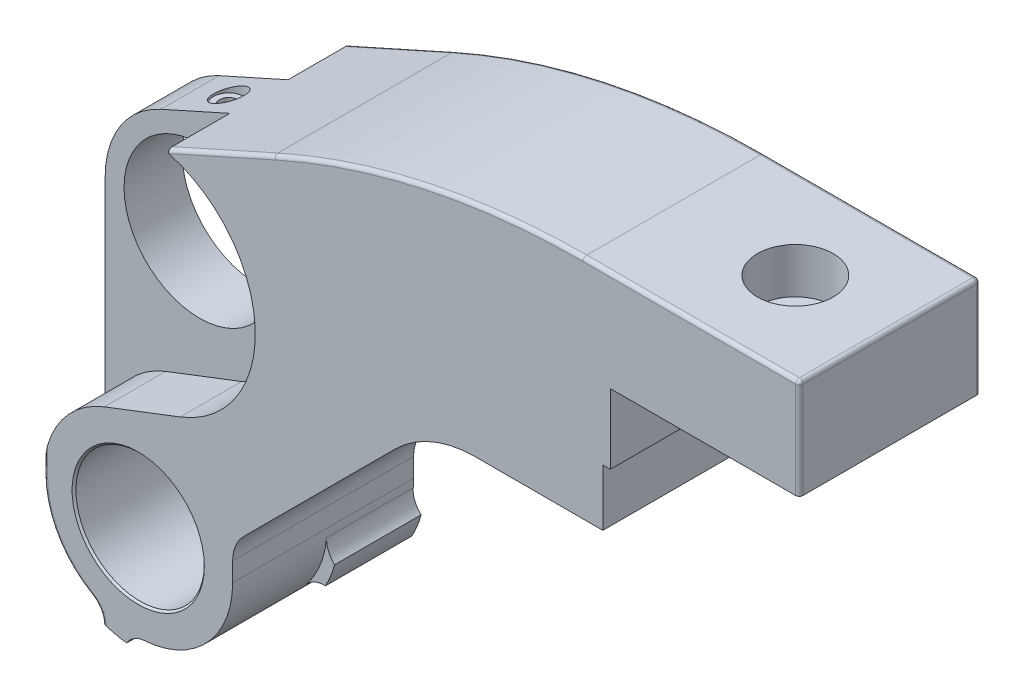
ISO-10303-21;
HEADER;
FILE_DESCRIPTION(('STEP AP214'),'2;1');
FILE_NAME('part.step','',(''),(''),'','','');
FILE_SCHEMA(('AUTOMOTIVE_DESIGN { 1 0 10303 214 1 1 1 1 }'));
ENDSEC;
DATA;
#1=APPLICATION_CONTEXT('core data for automotive mechanical design processes');
#2=APPLICATION_PROTOCOL_DEFINITION('international standard','automotive_design',2000,#1);
#3=PRODUCT_CONTEXT('',#1,'mechanical');
#4=PRODUCT('Part','Part','',(#3));
#5=PRODUCT_RELATED_PRODUCT_CATEGORY('part','',(#4));
#6=PRODUCT_DEFINITION_FORMATION('','',#4);
#7=PRODUCT_DEFINITION_CONTEXT('part definition',#1,'design');
#8=PRODUCT_DEFINITION('design','',#6,#7);
#9=PRODUCT_DEFINITION_SHAPE('','',#8);
#10=(LENGTH_UNIT() NAMED_UNIT(*) SI_UNIT(.MILLI.,.METRE.));
#11=(NAMED_UNIT(*) PLANE_ANGLE_UNIT() SI_UNIT($,.RADIAN.));
#12=(NAMED_UNIT(*) SI_UNIT($,.STERADIAN.) SOLID_ANGLE_UNIT());
#13=UNCERTAINTY_MEASURE_WITH_UNIT(LENGTH_MEASURE(1.E-05),#10,'distance_accuracy_value','');
#14=(GEOMETRIC_REPRESENTATION_CONTEXT(3) GLOBAL_UNCERTAINTY_ASSIGNED_CONTEXT((#13)) GLOBAL_UNIT_ASSIGNED_CONTEXT((#10,
#11,#12)) REPRESENTATION_CONTEXT('',''));
#15=CARTESIAN_POINT('',(0.,0.,0.));
#16=DIRECTION('',(0.,0.,1.));
#17=DIRECTION('',(1.,0.,0.));
#18=AXIS2_PLACEMENT_3D('',#15,#16,#17);
#19=CARTESIAN_POINT('',(0.,60.,23.95));
#20=DIRECTION('',(0.,0.,-1.));
#21=DIRECTION('',(-1.,0.,0.));
#22=AXIS2_PLACEMENT_3D('',#19,#20,#21);
#23=CYLINDRICAL_SURFACE('',#22,25.);
#24=CARTESIAN_POINT('',(0.,60.,-7.7));
#25=DIRECTION('',(0.,0.,-1.));
#26=DIRECTION('',(-1.,0.,0.));
#27=AXIS2_PLACEMENT_3D('',#24,#25,#26);
#28=CIRCLE('',#27,25.);
#29=CARTESIAN_POINT('',(-25.,60.,-7.7));
#30=VERTEX_POINT('',#29);
#31=CARTESIAN_POINT('',(-10.2224587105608,82.814498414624,-7.7));
#32=VERTEX_POINT('',#31);
#33=EDGE_CURVE('E1121',#30,#32,#28,.T.);
#34=ORIENTED_EDGE('',*,*,#33,.F.);
#35=DIRECTION('',(0.,0.,-1.));
#36=VECTOR('',#35,1.);
#37=CARTESIAN_POINT('',(-25.,60.,23.95));
#38=LINE('',#37,#36);
#39=CARTESIAN_POINT('',(-25.,60.,7.7));
#40=VERTEX_POINT('',#39);
#41=EDGE_CURVE('E704',#40,#30,#38,.T.);
#42=ORIENTED_EDGE('',*,*,#41,.F.);
#43=CARTESIAN_POINT('',(0.,60.,7.7));
#44=DIRECTION('',(0.,0.,1.));
#45=DIRECTION('',(1.,0.,0.));
#46=AXIS2_PLACEMENT_3D('',#43,#44,#45);
#47=CIRCLE('',#46,25.);
#48=CARTESIAN_POINT('',(-10.2224587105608,82.814498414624,7.7));
#49=VERTEX_POINT('',#48);
#50=EDGE_CURVE('E1163',#49,#40,#47,.T.);
#51=ORIENTED_EDGE('',*,*,#50,.F.);
#52=DIRECTION('',(0.,0.,-1.));
#53=VECTOR('',#52,1.);
#54=CARTESIAN_POINT('',(-10.2224587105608,82.814498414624,23.95));
#55=LINE('',#54,#53);
#56=EDGE_CURVE('E707',#49,#32,#55,.T.);
#57=ORIENTED_EDGE('',*,*,#56,.T.);
#58=EDGE_LOOP('',(#34,#42,#51,#57));
#59=FACE_BOUND('',#58,.T.);
#60=ADVANCED_FACE('F348',(#59),#23,.T.);
#61=CARTESIAN_POINT('',(-25.,60.,23.95));
#62=DIRECTION('',(1.,0.,0.));
#63=DIRECTION('',(0.,1.,0.));
#64=AXIS2_PLACEMENT_3D('',#61,#62,#63);
#65=PLANE('',#64);
#66=DIRECTION('',(0.,1.,0.));
#67=VECTOR('',#66,1.);
#68=CARTESIAN_POINT('',(-25.,60.,-7.7));
#69=LINE('',#68,#67);
#70=CARTESIAN_POINT('',(-25.,0.,-7.7));
#71=VERTEX_POINT('',#70);
#72=EDGE_CURVE('E1140',#71,#30,#69,.T.);
#73=ORIENTED_EDGE('',*,*,#72,.F.);
#74=DIRECTION('',(0.,0.,-1.));
#75=VECTOR('',#74,1.);
#76=CARTESIAN_POINT('',(-25.,0.,23.95));
#77=LINE('',#76,#75);
#78=CARTESIAN_POINT('',(-25.,0.,7.7));
#79=VERTEX_POINT('',#78);
#80=EDGE_CURVE('E701',#79,#71,#77,.T.);
#81=ORIENTED_EDGE('',*,*,#80,.F.);
#82=DIRECTION('',(0.,-1.,0.));
#83=VECTOR('',#82,1.);
#84=CARTESIAN_POINT('',(-25.,0.,7.7));
#85=LINE('',#84,#83);
#86=EDGE_CURVE('E1165',#40,#79,#85,.T.);
#87=ORIENTED_EDGE('',*,*,#86,.F.);
#88=ORIENTED_EDGE('',*,*,#41,.T.);
#89=EDGE_LOOP('',(#73,#81,#87,#88));
#90=FACE_BOUND('',#89,.T.);
#91=ADVANCED_FACE('F963',(#90),#65,.F.);
#92=CARTESIAN_POINT('',(0.,60.,23.95));
#93=DIRECTION('',(0.,0.,-1.));
#94=DIRECTION('',(-1.,0.,0.));
#95=AXIS2_PLACEMENT_3D('',#92,#93,#94);
#96=CYLINDRICAL_SURFACE('',#95,20.);
#97=CARTESIAN_POINT('',(0.,80.,2.5));
#98=CARTESIAN_POINT('',(-0.139841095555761,79.9999980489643,2.49999405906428));
#99=CARTESIAN_POINT('',(-0.279769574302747,79.998517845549,2.48822712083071));
#100=CARTESIAN_POINT('',(-0.555732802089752,79.9927554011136,2.4414722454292));
#101=CARTESIAN_POINT('',(-0.691763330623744,79.9884702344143,2.40646006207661));
#102=CARTESIAN_POINT('',(-0.955895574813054,79.9775806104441,2.31426235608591));
#103=CARTESIAN_POINT('',(-1.08400256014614,79.9709777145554,2.25709175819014));
#104=CARTESIAN_POINT('',(-1.32877947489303,79.956187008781,2.1222327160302));
#105=CARTESIAN_POINT('',(-1.44545136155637,79.9479994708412,2.04454779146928));
#106=CARTESIAN_POINT('',(-1.66471281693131,79.9309032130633,1.87040805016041));
#107=CARTESIAN_POINT('',(-1.76723036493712,79.9219911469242,1.77386287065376));
#108=CARTESIAN_POINT('',(-1.95465279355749,79.9044772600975,1.56493717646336));
#109=CARTESIAN_POINT('',(-2.03955677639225,79.8958754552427,1.45255585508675));
#110=CARTESIAN_POINT('',(-2.18961016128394,79.8799230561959,1.21468002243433));
#111=CARTESIAN_POINT('',(-2.25469209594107,79.8725767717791,1.08914263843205));
#112=CARTESIAN_POINT('',(-2.36282307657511,79.8600112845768,0.828812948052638));
#113=CARTESIAN_POINT('',(-2.40587295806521,79.8547920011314,0.694020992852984));
#114=CARTESIAN_POINT('',(-2.46849898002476,79.8471033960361,0.419755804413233));
#115=CARTESIAN_POINT('',(-2.4881967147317,79.8446198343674,0.280310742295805));
#116=CARTESIAN_POINT('',(-2.50393554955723,79.8426402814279,7.37365281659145E-05));
#117=CARTESIAN_POINT('',(-2.49997760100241,79.8431441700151,-0.140718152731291));
#118=CARTESIAN_POINT('',(-2.4686172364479,79.8470695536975,-0.418804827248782));
#119=CARTESIAN_POINT('',(-2.44134876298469,79.8504743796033,-0.556114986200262));
#120=CARTESIAN_POINT('',(-2.36435038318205,79.8597919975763,-0.824195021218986));
#121=CARTESIAN_POINT('',(-2.3146200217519,79.8657048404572,-0.954964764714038));
#122=CARTESIAN_POINT('',(-2.19396555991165,79.8793911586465,-1.20666799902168));
#123=CARTESIAN_POINT('',(-2.12298325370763,79.8871697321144,-1.32757330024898));
#124=CARTESIAN_POINT('',(-1.96188146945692,79.903707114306,-1.55580669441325));
#125=CARTESIAN_POINT('',(-1.87176111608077,79.9124659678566,-1.66313416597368));
#126=CARTESIAN_POINT('',(-1.67419911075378,79.9300510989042,-1.86194271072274));
#127=CARTESIAN_POINT('',(-1.56664200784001,79.9388774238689,-1.95330909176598));
#128=CARTESIAN_POINT('',(-1.33765716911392,79.9555463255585,-2.11670888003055));
#129=CARTESIAN_POINT('',(-1.21622940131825,79.963388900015,-2.188742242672));
#130=CARTESIAN_POINT('',(-0.962861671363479,79.9772115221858,-2.31143132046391));
#131=CARTESIAN_POINT('',(-0.830918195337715,79.9831909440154,-2.36207985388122));
#132=CARTESIAN_POINT('',(-0.560307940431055,79.9926078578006,-2.44047049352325));
#133=CARTESIAN_POINT('',(-0.421641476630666,79.9960454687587,-2.46821367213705));
#134=CARTESIAN_POINT('',(-0.142513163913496,79.9999759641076,-2.49985742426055));
#135=CARTESIAN_POINT('',(-0.00206949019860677,80.0004883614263,-2.50391599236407));
#136=CARTESIAN_POINT('',(0.277496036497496,79.9985633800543,-2.48849226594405));
#137=CARTESIAN_POINT('',(0.416617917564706,79.9961260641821,-2.4690104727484));
#138=CARTESIAN_POINT('',(0.689124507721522,79.9885876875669,-2.40719029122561));
#139=CARTESIAN_POINT('',(0.822526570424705,79.9834954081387,-2.36492723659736));
#140=CARTESIAN_POINT('',(1.08034965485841,79.971217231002,-2.25882254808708));
#141=CARTESIAN_POINT('',(1.20477037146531,79.9640312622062,-2.19498018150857));
#142=CARTESIAN_POINT('',(1.44180452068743,79.9483182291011,-2.04714686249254));
#143=CARTESIAN_POINT('',(1.55435375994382,79.9397844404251,-1.96305371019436));
#144=CARTESIAN_POINT('',(1.76379698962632,79.9223514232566,-1.77725050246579));
#145=CARTESIAN_POINT('',(1.86069035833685,79.913452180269,-1.67553974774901));
#146=CARTESIAN_POINT('',(2.03663195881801,79.8962310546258,-1.45669258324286));
#147=CARTESIAN_POINT('',(2.11557546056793,79.8879127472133,-1.3394716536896));
#148=CARTESIAN_POINT('',(2.2526528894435,79.8728541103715,-1.09334175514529));
#149=CARTESIAN_POINT('',(2.31078723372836,79.8661137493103,-0.96443302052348));
#150=CARTESIAN_POINT('',(2.40442657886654,79.8549985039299,-0.698924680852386));
#151=CARTESIAN_POINT('',(2.4399906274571,79.8506174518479,-0.562346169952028));
#152=CARTESIAN_POINT('',(2.48766999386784,79.8446991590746,-0.285097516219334));
#153=CARTESIAN_POINT('',(2.49978640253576,79.8431617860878,-0.144427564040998));
#154=CARTESIAN_POINT('',(2.50020653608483,79.8431087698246,0.13596892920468));
#155=CARTESIAN_POINT('',(2.48867479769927,79.8445722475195,0.275695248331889));
#156=CARTESIAN_POINT('',(2.44247440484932,79.850311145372,0.551207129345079));
#157=CARTESIAN_POINT('',(2.40780574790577,79.8545865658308,0.686992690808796));
#158=CARTESIAN_POINT('',(2.31636707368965,79.8654611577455,0.950746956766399));
#159=CARTESIAN_POINT('',(2.25960498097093,79.8720594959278,1.07871844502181));
#160=CARTESIAN_POINT('',(2.12560690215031,79.8868378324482,1.32334665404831));
#161=CARTESIAN_POINT('',(2.04837065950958,79.8950178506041,1.44000323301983));
#162=CARTESIAN_POINT('',(1.87500633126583,79.9121060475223,1.65953122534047));
#163=CARTESIAN_POINT('',(1.77875562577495,79.9210187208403,1.76230546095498));
#164=CARTESIAN_POINT('',(1.57035022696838,79.938528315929,1.95030682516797));
#165=CARTESIAN_POINT('',(1.45819178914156,79.9471251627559,2.03552981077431));
#166=CARTESIAN_POINT('',(1.22066562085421,79.9630705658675,2.18628535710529));
#167=CARTESIAN_POINT('',(1.09524927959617,79.970414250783,2.25174180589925));
#168=CARTESIAN_POINT('',(0.835182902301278,79.9829764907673,2.36057124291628));
#169=CARTESIAN_POINT('',(0.700543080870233,79.9881973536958,2.40396822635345));
#170=CARTESIAN_POINT('',(0.471005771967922,79.9946672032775,2.4570593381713));
#171=CARTESIAN_POINT('',(0.377555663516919,79.9966572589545,2.47313894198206));
#172=CARTESIAN_POINT('',(0.189417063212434,79.9993243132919,2.49461124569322));
#173=CARTESIAN_POINT('',(0.0947285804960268,80.0000013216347,2.5000040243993));
#174=CARTESIAN_POINT('',(0.,80.,2.5));
#175=B_SPLINE_CURVE_WITH_KNOTS('',3,(#97,#98,#99,#100,#101,#102,#103,#104,#105,#106,#107,#108,
#109,#110,#111,#112,#113,#114,#115,#116,#117,#118,#119,#120,#121,#122,#123,#124,#125,#126,#127,
#128,#129,#130,#131,#132,#133,#134,#135,#136,#137,#138,#139,#140,#141,#142,#143,#144,#145,#146,
#147,#148,#149,#150,#151,#152,#153,#154,#155,#156,#157,#158,#159,#160,#161,#162,#163,#164,#165,
#166,#167,#168,#169,#170,#171,#172,#173,#174),.UNSPECIFIED.,.T.,.F.,(4,2,2,2,2,2,2,2,2,2,2,2,2,
2,2,2,2,2,2,2,2,2,2,2,2,2,2,2,2,2,2,2,2,2,2,2,2,2,4),(0.,0.419177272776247,0.838792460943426,
1.25812550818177,1.67738665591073,2.09870813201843,2.5200510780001,2.94281250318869,
3.36555789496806,3.7860922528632,4.20660969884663,4.62472696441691,5.04285270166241,
5.46213426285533,5.88143500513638,6.30363478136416,6.72583553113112,7.14817795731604,
7.57050060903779,7.9900027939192,8.40949604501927,8.82761053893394,9.24573923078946,
9.66602402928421,10.0863255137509,10.5090197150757,10.9317054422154,11.3532807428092,
11.7748364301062,12.1934690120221,12.6121016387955,13.0305842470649,13.4490720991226,
13.8703523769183,14.2917319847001,14.7147140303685,15.1372349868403,15.4211884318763,
15.7051397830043),.UNSPECIFIED.);
#176=CARTESIAN_POINT('',(0.,80.,2.5));
#177=VERTEX_POINT('',#176);
#178=EDGE_CURVE('E352',#177,#177,#175,.T.);
#179=ORIENTED_EDGE('',*,*,#178,.F.);
#180=EDGE_LOOP('',(#179));
#181=FACE_BOUND('',#180,.T.);
#182=CARTESIAN_POINT('',(0.,60.,7.7));
#183=DIRECTION('',(0.,0.,1.));
#184=DIRECTION('',(1.,0.,0.));
#185=AXIS2_PLACEMENT_3D('',#182,#183,#184);
#186=CIRCLE('',#185,20.);
#187=CARTESIAN_POINT('',(20.,60.,7.7));
#188=VERTEX_POINT('',#187);
#189=EDGE_CURVE('E852',#188,#188,#186,.T.);
#190=ORIENTED_EDGE('',*,*,#189,.T.);
#191=EDGE_LOOP('',(#190));
#192=FACE_BOUND('',#191,.T.);
#193=CARTESIAN_POINT('',(0.,60.,-7.7));
#194=DIRECTION('',(0.,0.,-1.));
#195=DIRECTION('',(-1.,0.,0.));
#196=AXIS2_PLACEMENT_3D('',#193,#194,#195);
#197=CIRCLE('',#196,20.);
#198=CARTESIAN_POINT('',(-20.,60.,-7.7));
#199=VERTEX_POINT('',#198);
#200=EDGE_CURVE('E1144',#199,#199,#197,.T.);
#201=ORIENTED_EDGE('',*,*,#200,.T.);
#202=EDGE_LOOP('',(#201));
#203=FACE_BOUND('',#202,.T.);
#204=ADVANCED_FACE('F969',(#181,#192,#203),#96,.F.);
#205=CARTESIAN_POINT('',(-15.4424572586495,-26.8799277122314,23.95));
#206=DIRECTION('',(0.,0.,-1.));
#207=DIRECTION('',(-1.,0.,0.));
#208=AXIS2_PLACEMENT_3D('',#205,#206,#207);
#209=CYLINDRICAL_SURFACE('',#208,6.);
#210=CARTESIAN_POINT('',(-15.4424572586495,-26.8799277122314,1.05));
#211=DIRECTION('',(0.,0.,1.));
#212=DIRECTION('',(-1.,0.,0.));
#213=AXIS2_PLACEMENT_3D('',#210,#211,#212);
#214=CIRCLE('',#213,6.);
#215=CARTESIAN_POINT('',(-9.46577636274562,-26.3514530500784,1.05));
#216=VERTEX_POINT('',#215);
#217=CARTESIAN_POINT('',(-12.453594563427,-21.6773610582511,1.05));
#218=VERTEX_POINT('',#217);
#219=EDGE_CURVE('E942',#216,#218,#214,.T.);
#220=ORIENTED_EDGE('',*,*,#219,.F.);
#221=DIRECTION('',(0.,0.,1.));
#222=VECTOR('',#221,1.);
#223=CARTESIAN_POINT('',(-9.46577636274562,-26.3514530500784,-24.1324200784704));
#224=LINE('',#223,#222);
#225=CARTESIAN_POINT('',(-9.46577636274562,-26.3514530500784,22.95));
#226=VERTEX_POINT('',#225);
#227=EDGE_CURVE('E376',#216,#226,#224,.T.);
#228=ORIENTED_EDGE('',*,*,#227,.T.);
#229=CARTESIAN_POINT('',(-15.4424572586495,-26.8799277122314,22.95));
#230=DIRECTION('',(0.,0.,1.));
#231=DIRECTION('',(1.,0.,0.));
#232=AXIS2_PLACEMENT_3D('',#229,#230,#231);
#233=CIRCLE('',#232,6.);
#234=CARTESIAN_POINT('',(-12.453594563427,-21.6773610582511,22.95));
#235=VERTEX_POINT('',#234);
#236=EDGE_CURVE('E764',#226,#235,#233,.T.);
#237=ORIENTED_EDGE('',*,*,#236,.T.);
#238=DIRECTION('',(0.,0.,-1.));
#239=VECTOR('',#238,1.);
#240=CARTESIAN_POINT('',(-12.453594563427,-21.6773610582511,23.95));
#241=LINE('',#240,#239);
#242=EDGE_CURVE('E698',#235,#218,#241,.T.);
#243=ORIENTED_EDGE('',*,*,#242,.T.);
#244=EDGE_LOOP('',(#220,#228,#237,#243));
#245=FACE_BOUND('',#244,.T.);
#246=ADVANCED_FACE('F1228',(#245),#209,.F.);
#247=CARTESIAN_POINT('',(2.09620390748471,-30.9290466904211,23.95));
#248=DIRECTION('',(0.,0.,-1.));
#249=DIRECTION('',(-1.,0.,0.));
#250=AXIS2_PLACEMENT_3D('',#247,#248,#249);
#251=CYLINDRICAL_SURFACE('',#250,6.);
#252=CARTESIAN_POINT('',(2.09620390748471,-30.9290466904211,23.95));
#253=DIRECTION('',(0.,0.,-1.));
#254=DIRECTION('',(1.,0.,0.));
#255=AXIS2_PLACEMENT_3D('',#252,#253,#254);
#256=CIRCLE('',#255,6.);
#257=CARTESIAN_POINT('',(-3.04393325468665,-27.8340523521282,23.95));
#258=VERTEX_POINT('',#257);
#259=CARTESIAN_POINT('',(1.69048702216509,-24.9427795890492,23.95));
#260=VERTEX_POINT('',#259);
#261=EDGE_CURVE('E681',#258,#260,#256,.T.);
#262=ORIENTED_EDGE('',*,*,#261,.F.);
#263=DIRECTION('',(0.,0.,1.));
#264=VECTOR('',#263,1.);
#265=CARTESIAN_POINT('',(-3.04393325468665,-27.8340523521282,-24.1324200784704));
#266=LINE('',#265,#264);
#267=CARTESIAN_POINT('',(-3.04393325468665,-27.8340523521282,1.05));
#268=VERTEX_POINT('',#267);
#269=EDGE_CURVE('E883',#268,#258,#266,.T.);
#270=ORIENTED_EDGE('',*,*,#269,.F.);
#271=CARTESIAN_POINT('',(2.09620390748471,-30.9290466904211,1.05));
#272=DIRECTION('',(0.,0.,1.));
#273=DIRECTION('',(-1.,0.,0.));
#274=AXIS2_PLACEMENT_3D('',#271,#272,#273);
#275=CIRCLE('',#274,6.);
#276=CARTESIAN_POINT('',(1.69048702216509,-24.9427795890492,1.05));
#277=VERTEX_POINT('',#276);
#278=EDGE_CURVE('E1217',#277,#268,#275,.T.);
#279=ORIENTED_EDGE('',*,*,#278,.F.);
#280=DIRECTION('',(0.,0.,-1.));
#281=VECTOR('',#280,1.);
#282=CARTESIAN_POINT('',(1.69048702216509,-24.9427795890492,23.95));
#283=LINE('',#282,#281);
#284=EDGE_CURVE('E695',#260,#277,#283,.T.);
#285=ORIENTED_EDGE('',*,*,#284,.F.);
#286=EDGE_LOOP('',(#262,#270,#279,#285));
#287=FACE_BOUND('',#286,.T.);
#288=ADVANCED_FACE('F1239',(#287),#251,.F.);
#289=CARTESIAN_POINT('',(24.1332586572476,-19.4572820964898,23.95));
#290=DIRECTION('',(0.,0.,-1.));
#291=DIRECTION('',(-1.,0.,0.));
#292=AXIS2_PLACEMENT_3D('',#289,#290,#291);
#293=CYLINDRICAL_SURFACE('',#292,6.);
#294=CARTESIAN_POINT('',(24.1332586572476,-19.4572820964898,-23.95));
#295=DIRECTION('',(0.,0.,-1.));
#296=DIRECTION('',(1.,0.,0.));
#297=AXIS2_PLACEMENT_3D('',#294,#295,#296);
#298=CIRCLE('',#297,6.);
#299=CARTESIAN_POINT('',(19.4623053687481,-15.6913565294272,-23.95));
#300=VERTEX_POINT('',#299);
#301=CARTESIAN_POINT('',(24.5462492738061,-13.4715124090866,-23.95));
#302=VERTEX_POINT('',#301);
#303=EDGE_CURVE('E653',#300,#302,#298,.T.);
#304=ORIENTED_EDGE('',*,*,#303,.T.);
#305=DIRECTION('',(0.,0.,1.));
#306=VECTOR('',#305,1.);
#307=CARTESIAN_POINT('',(24.5462492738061,-13.4715124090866,-24.1324200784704));
#308=LINE('',#307,#306);
#309=CARTESIAN_POINT('',(24.5462492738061,-13.4715124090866,-1.05));
#310=VERTEX_POINT('',#309);
#311=EDGE_CURVE('E632',#302,#310,#308,.T.);
#312=ORIENTED_EDGE('',*,*,#311,.T.);
#313=CARTESIAN_POINT('',(24.1332586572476,-19.4572820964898,-1.05));
#314=DIRECTION('',(0.,0.,-1.));
#315=DIRECTION('',(1.,0.,0.));
#316=AXIS2_PLACEMENT_3D('',#313,#314,#315);
#317=CIRCLE('',#316,6.);
#318=CARTESIAN_POINT('',(19.4623053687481,-15.6913565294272,-1.05));
#319=VERTEX_POINT('',#318);
#320=EDGE_CURVE('E941',#319,#310,#317,.T.);
#321=ORIENTED_EDGE('',*,*,#320,.F.);
#322=DIRECTION('',(0.,0.,-1.));
#323=VECTOR('',#322,1.);
#324=CARTESIAN_POINT('',(19.4623053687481,-15.6913565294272,23.95));
#325=LINE('',#324,#323);
#326=EDGE_CURVE('E693',#319,#300,#325,.T.);
#327=ORIENTED_EDGE('',*,*,#326,.T.);
#328=EDGE_LOOP('',(#304,#312,#321,#327));
#329=FACE_BOUND('',#328,.T.);
#330=ADVANCED_FACE('F1068',(#329),#293,.F.);
#331=CARTESIAN_POINT('',(30.8761773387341,-2.76797271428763,23.95));
#332=DIRECTION('',(0.,0.,-1.));
#333=DIRECTION('',(-1.,0.,0.));
#334=AXIS2_PLACEMENT_3D('',#331,#332,#333);
#335=CYLINDRICAL_SURFACE('',#334,6.);
#336=CARTESIAN_POINT('',(30.8761773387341,-2.76797271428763,-1.05));
#337=DIRECTION('',(0.,0.,-1.));
#338=DIRECTION('',(1.,0.,0.));
#339=AXIS2_PLACEMENT_3D('',#336,#337,#338);
#340=CIRCLE('',#339,6.);
#341=CARTESIAN_POINT('',(27.0151929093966,-7.36066247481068,-1.05));
#342=VERTEX_POINT('',#341);
#343=CARTESIAN_POINT('',(24.9001430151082,-2.23223605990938,-1.05));
#344=VERTEX_POINT('',#343);
#345=EDGE_CURVE('E645',#342,#344,#340,.T.);
#346=ORIENTED_EDGE('',*,*,#345,.F.);
#347=DIRECTION('',(0.,0.,1.));
#348=VECTOR('',#347,1.);
#349=CARTESIAN_POINT('',(27.0151929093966,-7.36066247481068,-24.1324200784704));
#350=LINE('',#349,#348);
#351=CARTESIAN_POINT('',(27.0151929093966,-7.36066247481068,-23.95));
#352=VERTEX_POINT('',#351);
#353=EDGE_CURVE('E368',#352,#342,#350,.T.);
#354=ORIENTED_EDGE('',*,*,#353,.F.);
#355=CARTESIAN_POINT('',(30.8761773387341,-2.76797271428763,-23.95));
#356=DIRECTION('',(0.,0.,-1.));
#357=DIRECTION('',(1.,0.,0.));
#358=AXIS2_PLACEMENT_3D('',#355,#356,#357);
#359=CIRCLE('',#358,6.);
#360=CARTESIAN_POINT('',(24.9001430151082,-2.23223605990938,-23.95));
#361=VERTEX_POINT('',#360);
#362=EDGE_CURVE('E643',#352,#361,#359,.T.);
#363=ORIENTED_EDGE('',*,*,#362,.T.);
#364=DIRECTION('',(0.,0.,-1.));
#365=VECTOR('',#364,1.);
#366=CARTESIAN_POINT('',(24.9001430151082,-2.23223605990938,23.95));
#367=LINE('',#366,#365);
#368=EDGE_CURVE('E691',#344,#361,#367,.T.);
#369=ORIENTED_EDGE('',*,*,#368,.F.);
#370=EDGE_LOOP('',(#346,#354,#363,#369));
#371=FACE_BOUND('',#370,.T.);
#372=ADVANCED_FACE('F641',(#371),#335,.F.);
#373=CARTESIAN_POINT('',(35.,5.,23.95));
#374=DIRECTION('',(0.,0.,1.));
#375=DIRECTION('',(1.,0.,0.));
#376=AXIS2_PLACEMENT_3D('',#373,#374,#375);
#377=PLANE('',#376);
#378=CARTESIAN_POINT('',(0.,0.,23.95));
#379=DIRECTION('',(0.,0.,-1.));
#380=DIRECTION('',(1.,0.,0.));
#381=AXIS2_PLACEMENT_3D('',#378,#379,#380);
#382=CIRCLE('',#381,28.);
#383=CARTESIAN_POINT('',(-8.44487024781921,-26.6961451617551,23.95));
#384=VERTEX_POINT('',#383);
#385=EDGE_CURVE('E637',#258,#384,#382,.T.);
#386=ORIENTED_EDGE('',*,*,#385,.F.);
#387=ORIENTED_EDGE('',*,*,#261,.T.);
#388=CARTESIAN_POINT('',(0.,0.,23.95));
#389=DIRECTION('',(0.,0.,1.));
#390=DIRECTION('',(1.,0.,0.));
#391=AXIS2_PLACEMENT_3D('',#388,#389,#390);
#392=CIRCLE('',#391,25.);
#393=CARTESIAN_POINT('',(25.,0.,23.95));
#394=VERTEX_POINT('',#393);
#395=EDGE_CURVE('E683',#260,#394,#392,.T.);
#396=ORIENTED_EDGE('',*,*,#395,.T.);
#397=DIRECTION('',(0.,1.,0.));
#398=VECTOR('',#397,1.);
#399=CARTESIAN_POINT('',(25.,5.,23.95));
#400=LINE('',#399,#398);
#401=CARTESIAN_POINT('',(25.,5.,23.95));
#402=VERTEX_POINT('',#401);
#403=EDGE_CURVE('E685',#394,#402,#400,.T.);
#404=ORIENTED_EDGE('',*,*,#403,.T.);
#405=CARTESIAN_POINT('',(35.,5.,23.95));
#406=DIRECTION('',(0.,0.,-1.));
#407=DIRECTION('',(1.,0.,0.));
#408=AXIS2_PLACEMENT_3D('',#405,#406,#407);
#409=CIRCLE('',#408,9.99999999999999);
#410=CARTESIAN_POINT('',(27.9289321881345,12.0710678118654,23.95));
#411=VERTEX_POINT('',#410);
#412=EDGE_CURVE('E663',#402,#411,#409,.T.);
#413=ORIENTED_EDGE('',*,*,#412,.T.);
#414=DIRECTION('',(0.707106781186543,0.707106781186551,0.));
#415=VECTOR('',#414,1.);
#416=CARTESIAN_POINT('',(68.071067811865,52.2132034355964,23.95));
#417=LINE('',#416,#415);
#418=CARTESIAN_POINT('',(68.071067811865,52.2132034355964,23.95));
#419=VERTEX_POINT('',#418);
#420=EDGE_CURVE('E666',#411,#419,#417,.T.);
#421=ORIENTED_EDGE('',*,*,#420,.T.);
#422=CARTESIAN_POINT('',(89.2842712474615,31.0000000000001,23.95));
#423=DIRECTION('',(0.,0.,-1.));
#424=DIRECTION('',(1.,0.,0.));
#425=AXIS2_PLACEMENT_3D('',#422,#423,#424);
#426=CIRCLE('',#425,30.);
#427=CARTESIAN_POINT('',(89.2842712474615,61.0000000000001,23.95));
#428=VERTEX_POINT('',#427);
#429=EDGE_CURVE('E668',#419,#428,#426,.T.);
#430=ORIENTED_EDGE('',*,*,#429,.T.);
#431=DIRECTION('',(1.,0.,0.));
#432=VECTOR('',#431,1.);
#433=CARTESIAN_POINT('',(123.,61.0000000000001,23.95));
#434=LINE('',#433,#432);
#435=CARTESIAN_POINT('',(123.,61.0000000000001,23.95));
#436=VERTEX_POINT('',#435);
#437=EDGE_CURVE('E670',#428,#436,#434,.T.);
#438=ORIENTED_EDGE('',*,*,#437,.T.);
#439=DIRECTION('',(0.,1.,0.));
#440=VECTOR('',#439,1.);
#441=CARTESIAN_POINT('',(123.,61.0000000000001,23.95));
#442=LINE('',#441,#440);
#443=CARTESIAN_POINT('',(123.,76.,23.95));
#444=VERTEX_POINT('',#443);
#445=EDGE_CURVE('E672',#436,#444,#442,.T.);
#446=ORIENTED_EDGE('',*,*,#445,.T.);
#447=DIRECTION('',(1.,0.,0.));
#448=VECTOR('',#447,1.);
#449=CARTESIAN_POINT('',(123.,76.,23.95));
#450=LINE('',#449,#448);
#451=CARTESIAN_POINT('',(125.,76.,23.95));
#452=VERTEX_POINT('',#451);
#453=EDGE_CURVE('E674',#444,#452,#450,.T.);
#454=ORIENTED_EDGE('',*,*,#453,.T.);
#455=DIRECTION('',(0.,1.,0.));
#456=VECTOR('',#455,1.);
#457=CARTESIAN_POINT('',(125.,94.5,23.95));
#458=LINE('',#457,#456);
#459=CARTESIAN_POINT('',(125.,94.5,23.95));
#460=VERTEX_POINT('',#459);
#461=EDGE_CURVE('E676',#452,#460,#458,.T.);
#462=ORIENTED_EDGE('',*,*,#461,.T.);
#463=DIRECTION('',(1.,0.,0.));
#464=VECTOR('',#463,1.);
#465=CARTESIAN_POINT('',(125.,94.5,23.95));
#466=LINE('',#465,#464);
#467=CARTESIAN_POINT('',(174.,94.5,23.95));
#468=VERTEX_POINT('',#467);
#469=EDGE_CURVE('E678',#460,#468,#466,.T.);
#470=ORIENTED_EDGE('',*,*,#469,.T.);
#471=DIRECTION('',(0.,1.,0.));
#472=VECTOR('',#471,1.);
#473=CARTESIAN_POINT('',(174.,121.,23.95));
#474=LINE('',#473,#472);
#475=CARTESIAN_POINT('',(174.,120.,23.95));
#476=VERTEX_POINT('',#475);
#477=EDGE_CURVE('E740',#468,#476,#474,.T.);
#478=ORIENTED_EDGE('',*,*,#477,.T.);
#479=DIRECTION('',(-1.,0.,0.));
#480=VECTOR('',#479,1.);
#481=CARTESIAN_POINT('',(117.758824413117,120.,23.95));
#482=LINE('',#481,#480);
#483=CARTESIAN_POINT('',(117.758824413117,120.,23.95));
#484=VERTEX_POINT('',#483);
#485=EDGE_CURVE('E733',#476,#484,#482,.T.);
#486=ORIENTED_EDGE('',*,*,#485,.T.);
#487=CARTESIAN_POINT('',(117.758824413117,-79.,23.95));
#488=DIRECTION('',(0.,0.,1.));
#489=DIRECTION('',(1.,0.,0.));
#490=AXIS2_PLACEMENT_3D('',#487,#488,#489);
#491=CIRCLE('',#490,199.);
#492=CARTESIAN_POINT('',(36.3880530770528,102.603407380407,23.95));
#493=VERTEX_POINT('',#492);
#494=EDGE_CURVE('E735',#484,#493,#491,.T.);
#495=ORIENTED_EDGE('',*,*,#494,.T.);
#496=DIRECTION('',(-0.912579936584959,-0.408898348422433,0.));
#497=VECTOR('',#496,1.);
#498=CARTESIAN_POINT('',(-9.8135603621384,81.901918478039,23.95));
#499=LINE('',#498,#497);
#500=CARTESIAN_POINT('',(8.0925510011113,89.9250834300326,23.95));
#501=VERTEX_POINT('',#500);
#502=EDGE_CURVE('E737',#493,#501,#499,.T.);
#503=ORIENTED_EDGE('',*,*,#502,.T.);
#504=CARTESIAN_POINT('',(0.,60.,23.95));
#505=DIRECTION('',(0.,0.,1.));
#506=DIRECTION('',(1.,0.,0.));
#507=AXIS2_PLACEMENT_3D('',#504,#505,#506);
#508=CIRCLE('',#507,31.);
#509=CARTESIAN_POINT('',(11.1293406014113,31.0666666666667,23.95));
#510=VERTEX_POINT('',#509);
#511=EDGE_CURVE('E1159',#510,#501,#508,.T.);
#512=ORIENTED_EDGE('',*,*,#511,.F.);
#513=DIRECTION('',(0.933333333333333,0.3590109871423,0.));
#514=VECTOR('',#513,1.);
#515=CARTESIAN_POINT('',(11.1293406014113,31.0666666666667,23.95));
#516=LINE('',#515,#514);
#517=CARTESIAN_POINT('',(-8.9752746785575,23.3333333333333,23.95));
#518=VERTEX_POINT('',#517);
#519=EDGE_CURVE('E1156',#518,#510,#516,.T.);
#520=ORIENTED_EDGE('',*,*,#519,.F.);
#521=CARTESIAN_POINT('',(0.,0.,23.95));
#522=DIRECTION('',(0.,0.,-1.));
#523=DIRECTION('',(1.,0.,0.));
#524=AXIS2_PLACEMENT_3D('',#521,#522,#523);
#525=CIRCLE('',#524,25.);
#526=CARTESIAN_POINT('',(-24.,6.99999999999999,23.95));
#527=VERTEX_POINT('',#526);
#528=EDGE_CURVE('E1154',#527,#518,#525,.T.);
#529=ORIENTED_EDGE('',*,*,#528,.F.);
#530=DIRECTION('',(0.,-1.,0.));
#531=VECTOR('',#530,1.);
#532=CARTESIAN_POINT('',(-24.,0.,23.95));
#533=LINE('',#532,#531);
#534=CARTESIAN_POINT('',(-24.,0.,23.95));
#535=VERTEX_POINT('',#534);
#536=EDGE_CURVE('E742',#527,#535,#533,.T.);
#537=ORIENTED_EDGE('',*,*,#536,.T.);
#538=CARTESIAN_POINT('',(0.,0.,23.95));
#539=DIRECTION('',(0.,0.,1.));
#540=DIRECTION('',(1.,0.,0.));
#541=AXIS2_PLACEMENT_3D('',#538,#539,#540);
#542=CIRCLE('',#541,24.);
#543=CARTESIAN_POINT('',(-11.9554507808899,-20.810266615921,23.95));
#544=VERTEX_POINT('',#543);
#545=EDGE_CURVE('E744',#535,#544,#542,.T.);
#546=ORIENTED_EDGE('',*,*,#545,.T.);
#547=CARTESIAN_POINT('',(-15.4424572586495,-26.8799277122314,23.95));
#548=DIRECTION('',(0.,0.,1.));
#549=DIRECTION('',(1.,0.,0.));
#550=AXIS2_PLACEMENT_3D('',#547,#548,#549);
#551=CIRCLE('',#550,7.);
#552=EDGE_CURVE('E746',#544,#384,#551,.F.);
#553=ORIENTED_EDGE('',*,*,#552,.T.);
#554=EDGE_LOOP('',(#386,#387,#396,#404,#413,#421,#430,#438,#446,#454,#462,#470,#478,#486,#495,
#503,#512,#520,#529,#537,#546,#553));
#555=FACE_BOUND('',#554,.T.);
#556=CARTESIAN_POINT('',(0.,0.,23.95));
#557=DIRECTION('',(0.,0.,1.));
#558=DIRECTION('',(1.,0.,0.));
#559=AXIS2_PLACEMENT_3D('',#556,#557,#558);
#560=CIRCLE('',#559,17.5);
#561=CARTESIAN_POINT('',(17.5,0.,23.95));
#562=VERTEX_POINT('',#561);
#563=EDGE_CURVE('E803',#562,#562,#560,.F.);
#564=ORIENTED_EDGE('',*,*,#563,.T.);
#565=EDGE_LOOP('',(#564));
#566=FACE_BOUND('',#565,.T.);
#567=ADVANCED_FACE('F1021',(#555,#566),#377,.T.);
#568=CARTESIAN_POINT('',(35.,5.,23.95));
#569=DIRECTION('',(0.,0.,-1.));
#570=DIRECTION('',(-1.,0.,0.));
#571=AXIS2_PLACEMENT_3D('',#568,#569,#570);
#572=CYLINDRICAL_SURFACE('',#571,9.99999999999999);
#573=DIRECTION('',(0.,0.,-1.));
#574=VECTOR('',#573,1.);
#575=CARTESIAN_POINT('',(25.,5.,23.95));
#576=LINE('',#575,#574);
#577=CARTESIAN_POINT('',(25.,5.,-23.95));
#578=VERTEX_POINT('',#577);
#579=EDGE_CURVE('E687',#402,#578,#576,.T.);
#580=ORIENTED_EDGE('',*,*,#579,.T.);
#581=CARTESIAN_POINT('',(35.,5.,-23.95));
#582=DIRECTION('',(0.,0.,-1.));
#583=DIRECTION('',(1.,0.,0.));
#584=AXIS2_PLACEMENT_3D('',#581,#582,#583);
#585=CIRCLE('',#584,9.99999999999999);
#586=CARTESIAN_POINT('',(27.9289321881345,12.0710678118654,-23.95));
#587=VERTEX_POINT('',#586);
#588=EDGE_CURVE('E1032',#578,#587,#585,.T.);
#589=ORIENTED_EDGE('',*,*,#588,.T.);
#590=DIRECTION('',(0.,0.,-1.));
#591=VECTOR('',#590,1.);
#592=CARTESIAN_POINT('',(27.9289321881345,12.0710678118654,23.95));
#593=LINE('',#592,#591);
#594=EDGE_CURVE('E731',#411,#587,#593,.T.);
#595=ORIENTED_EDGE('',*,*,#594,.F.);
#596=ORIENTED_EDGE('',*,*,#412,.F.);
#597=EDGE_LOOP('',(#580,#589,#595,#596));
#598=FACE_BOUND('',#597,.T.);
#599=ADVANCED_FACE('F350',(#598),#572,.F.);
#600=CARTESIAN_POINT('',(68.071067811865,52.2132034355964,23.95));
#601=DIRECTION('',(-0.707106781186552,0.707106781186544,0.));
#602=DIRECTION('',(-0.707106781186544,-0.707106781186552,0.));
#603=AXIS2_PLACEMENT_3D('',#600,#601,#602);
#604=PLANE('',#603);
#605=ORIENTED_EDGE('',*,*,#594,.T.);
#606=DIRECTION('',(0.707106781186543,0.707106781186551,0.));
#607=VECTOR('',#606,1.);
#608=CARTESIAN_POINT('',(68.071067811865,52.2132034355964,-23.95));
#609=LINE('',#608,#607);
#610=CARTESIAN_POINT('',(68.071067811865,52.2132034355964,-23.95));
#611=VERTEX_POINT('',#610);
#612=EDGE_CURVE('E1027',#587,#611,#609,.T.);
#613=ORIENTED_EDGE('',*,*,#612,.T.);
#614=DIRECTION('',(0.,0.,-1.));
#615=VECTOR('',#614,1.);
#616=CARTESIAN_POINT('',(68.071067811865,52.2132034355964,23.95));
#617=LINE('',#616,#615);
#618=EDGE_CURVE('E729',#419,#611,#617,.T.);
#619=ORIENTED_EDGE('',*,*,#618,.F.);
#620=ORIENTED_EDGE('',*,*,#420,.F.);
#621=EDGE_LOOP('',(#605,#613,#619,#620));
#622=FACE_BOUND('',#621,.T.);
#623=ADVANCED_FACE('F1014',(#622),#604,.F.);
#624=CARTESIAN_POINT('',(89.2842712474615,31.0000000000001,23.95));
#625=DIRECTION('',(0.,0.,-1.));
#626=DIRECTION('',(-1.,0.,0.));
#627=AXIS2_PLACEMENT_3D('',#624,#625,#626);
#628=CYLINDRICAL_SURFACE('',#627,30.);
#629=ORIENTED_EDGE('',*,*,#618,.T.);
#630=CARTESIAN_POINT('',(89.2842712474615,31.0000000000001,-23.95));
#631=DIRECTION('',(0.,0.,-1.));
#632=DIRECTION('',(1.,0.,0.));
#633=AXIS2_PLACEMENT_3D('',#630,#631,#632);
#634=CIRCLE('',#633,30.);
#635=CARTESIAN_POINT('',(89.2842712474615,61.0000000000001,-23.95));
#636=VERTEX_POINT('',#635);
#637=EDGE_CURVE('E1035',#611,#636,#634,.T.);
#638=ORIENTED_EDGE('',*,*,#637,.T.);
#639=DIRECTION('',(0.,0.,-1.));
#640=VECTOR('',#639,1.);
#641=CARTESIAN_POINT('',(89.2842712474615,61.0000000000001,23.95));
#642=LINE('',#641,#640);
#643=EDGE_CURVE('E727',#428,#636,#642,.T.);
#644=ORIENTED_EDGE('',*,*,#643,.F.);
#645=ORIENTED_EDGE('',*,*,#429,.F.);
#646=EDGE_LOOP('',(#629,#638,#644,#645));
#647=FACE_BOUND('',#646,.T.);
#648=ADVANCED_FACE('F1011',(#647),#628,.F.);
#649=CARTESIAN_POINT('',(123.,61.0000000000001,23.95));
#650=DIRECTION('',(0.,1.,0.));
#651=DIRECTION('',(-1.,0.,0.));
#652=AXIS2_PLACEMENT_3D('',#649,#650,#651);
#653=PLANE('',#652);
#654=ORIENTED_EDGE('',*,*,#643,.T.);
#655=DIRECTION('',(1.,0.,0.));
#656=VECTOR('',#655,1.);
#657=CARTESIAN_POINT('',(123.,61.0000000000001,-23.95));
#658=LINE('',#657,#656);
#659=CARTESIAN_POINT('',(123.,61.0000000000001,-23.95));
#660=VERTEX_POINT('',#659);
#661=EDGE_CURVE('E1046',#636,#660,#658,.T.);
#662=ORIENTED_EDGE('',*,*,#661,.T.);
#663=DIRECTION('',(0.,0.,-1.));
#664=VECTOR('',#663,1.);
#665=CARTESIAN_POINT('',(123.,61.0000000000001,23.95));
#666=LINE('',#665,#664);
#667=EDGE_CURVE('E725',#436,#660,#666,.T.);
#668=ORIENTED_EDGE('',*,*,#667,.F.);
#669=ORIENTED_EDGE('',*,*,#437,.F.);
#670=EDGE_LOOP('',(#654,#662,#668,#669));
#671=FACE_BOUND('',#670,.T.);
#672=ADVANCED_FACE('F1007',(#671),#653,.F.);
#673=CARTESIAN_POINT('',(123.,61.0000000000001,23.95));
#674=DIRECTION('',(-1.,0.,0.));
#675=DIRECTION('',(0.,0.,1.));
#676=AXIS2_PLACEMENT_3D('',#673,#674,#675);
#677=PLANE('',#676);
#678=ORIENTED_EDGE('',*,*,#667,.T.);
#679=DIRECTION('',(0.,1.,0.));
#680=VECTOR('',#679,1.);
#681=CARTESIAN_POINT('',(123.,61.0000000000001,-23.95));
#682=LINE('',#681,#680);
#683=CARTESIAN_POINT('',(123.,76.,-23.95));
#684=VERTEX_POINT('',#683);
#685=EDGE_CURVE('E1049',#660,#684,#682,.T.);
#686=ORIENTED_EDGE('',*,*,#685,.T.);
#687=DIRECTION('',(0.,0.,-1.));
#688=VECTOR('',#687,1.);
#689=CARTESIAN_POINT('',(123.,76.,23.95));
#690=LINE('',#689,#688);
#691=EDGE_CURVE('E723',#444,#684,#690,.T.);
#692=ORIENTED_EDGE('',*,*,#691,.F.);
#693=ORIENTED_EDGE('',*,*,#445,.F.);
#694=EDGE_LOOP('',(#678,#686,#692,#693));
#695=FACE_BOUND('',#694,.T.);
#696=ADVANCED_FACE('F1003',(#695),#677,.F.);
#697=CARTESIAN_POINT('',(123.,76.,23.95));
#698=DIRECTION('',(0.,1.,0.));
#699=DIRECTION('',(0.,0.,1.));
#700=AXIS2_PLACEMENT_3D('',#697,#698,#699);
#701=PLANE('',#700);
#702=ORIENTED_EDGE('',*,*,#691,.T.);
#703=DIRECTION('',(1.,0.,0.));
#704=VECTOR('',#703,1.);
#705=CARTESIAN_POINT('',(123.,76.,-23.95));
#706=LINE('',#705,#704);
#707=CARTESIAN_POINT('',(125.,76.,-23.95));
#708=VERTEX_POINT('',#707);
#709=EDGE_CURVE('E1052',#684,#708,#706,.T.);
#710=ORIENTED_EDGE('',*,*,#709,.T.);
#711=DIRECTION('',(0.,0.,-1.));
#712=VECTOR('',#711,1.);
#713=CARTESIAN_POINT('',(125.,76.,23.95));
#714=LINE('',#713,#712);
#715=EDGE_CURVE('E721',#452,#708,#714,.T.);
#716=ORIENTED_EDGE('',*,*,#715,.F.);
#717=ORIENTED_EDGE('',*,*,#453,.F.);
#718=EDGE_LOOP('',(#702,#710,#716,#717));
#719=FACE_BOUND('',#718,.T.);
#720=ADVANCED_FACE('F999',(#719),#701,.F.);
#721=CARTESIAN_POINT('',(125.,94.5,23.95));
#722=DIRECTION('',(-1.,0.,0.));
#723=DIRECTION('',(0.,-1.,0.));
#724=AXIS2_PLACEMENT_3D('',#721,#722,#723);
#725=PLANE('',#724);
#726=ORIENTED_EDGE('',*,*,#715,.T.);
#727=DIRECTION('',(0.,1.,0.));
#728=VECTOR('',#727,1.);
#729=CARTESIAN_POINT('',(125.,94.5,-23.95));
#730=LINE('',#729,#728);
#731=CARTESIAN_POINT('',(125.,94.5,-23.95));
#732=VERTEX_POINT('',#731);
#733=EDGE_CURVE('E1055',#708,#732,#730,.T.);
#734=ORIENTED_EDGE('',*,*,#733,.T.);
#735=DIRECTION('',(0.,0.,-1.));
#736=VECTOR('',#735,1.);
#737=CARTESIAN_POINT('',(125.,94.5,23.95));
#738=LINE('',#737,#736);
#739=EDGE_CURVE('E719',#460,#732,#738,.T.);
#740=ORIENTED_EDGE('',*,*,#739,.F.);
#741=ORIENTED_EDGE('',*,*,#461,.F.);
#742=EDGE_LOOP('',(#726,#734,#740,#741));
#743=FACE_BOUND('',#742,.T.);
#744=ADVANCED_FACE('F995',(#743),#725,.F.);
#745=CARTESIAN_POINT('',(125.,94.5,23.95));
#746=DIRECTION('',(0.,1.,0.));
#747=DIRECTION('',(0.,0.,1.));
#748=AXIS2_PLACEMENT_3D('',#745,#746,#747);
#749=PLANE('',#748);
#750=CARTESIAN_POINT('',(150.,94.5,0.));
#751=DIRECTION('',(0.,1.,0.));
#752=DIRECTION('',(0.,0.,1.));
#753=AXIS2_PLACEMENT_3D('',#750,#751,#752);
#754=CIRCLE('',#753,6.49999999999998);
#755=CARTESIAN_POINT('',(150.,94.5,6.49999999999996));
#756=VERTEX_POINT('',#755);
#757=EDGE_CURVE('E810',#756,#756,#754,.T.);
#758=ORIENTED_EDGE('',*,*,#757,.T.);
#759=EDGE_LOOP('',(#758));
#760=FACE_BOUND('',#759,.T.);
#761=DIRECTION('',(1.,0.,0.));
#762=VECTOR('',#761,1.);
#763=CARTESIAN_POINT('',(125.,94.5,-23.95));
#764=LINE('',#763,#762);
#765=CARTESIAN_POINT('',(174.,94.5,-23.95));
#766=VERTEX_POINT('',#765);
#767=EDGE_CURVE('E1058',#732,#766,#764,.T.);
#768=ORIENTED_EDGE('',*,*,#767,.T.);
#769=CARTESIAN_POINT('',(174.,94.5,-22.95));
#770=DIRECTION('',(0.,1.,0.));
#771=DIRECTION('',(0.,0.,1.));
#772=AXIS2_PLACEMENT_3D('',#769,#770,#771);
#773=CIRCLE('',#772,1.);
#774=CARTESIAN_POINT('',(175.,94.5,-22.95));
#775=VERTEX_POINT('',#774);
#776=EDGE_CURVE('E780',#766,#775,#773,.F.);
#777=ORIENTED_EDGE('',*,*,#776,.T.);
#778=DIRECTION('',(0.,0.,-1.));
#779=VECTOR('',#778,1.);
#780=CARTESIAN_POINT('',(175.,94.5,23.95));
#781=LINE('',#780,#779);
#782=CARTESIAN_POINT('',(175.,94.5,22.95));
#783=VERTEX_POINT('',#782);
#784=EDGE_CURVE('E716',#783,#775,#781,.T.);
#785=ORIENTED_EDGE('',*,*,#784,.F.);
#786=CARTESIAN_POINT('',(174.,94.5,22.95));
#787=DIRECTION('',(0.,1.,0.));
#788=DIRECTION('',(0.,0.,1.));
#789=AXIS2_PLACEMENT_3D('',#786,#787,#788);
#790=CIRCLE('',#789,1.);
#791=EDGE_CURVE('E778',#783,#468,#790,.F.);
#792=ORIENTED_EDGE('',*,*,#791,.T.);
#793=ORIENTED_EDGE('',*,*,#469,.F.);
#794=ORIENTED_EDGE('',*,*,#739,.T.);
#795=EDGE_LOOP('',(#768,#777,#785,#792,#793,#794));
#796=FACE_BOUND('',#795,.T.);
#797=ADVANCED_FACE('F991',(#760,#796),#749,.F.);
#798=CARTESIAN_POINT('',(175.,94.5,23.95));
#799=DIRECTION('',(-1.,0.,0.));
#800=DIRECTION('',(0.,0.,1.));
#801=AXIS2_PLACEMENT_3D('',#798,#799,#800);
#802=PLANE('',#801);
#803=ORIENTED_EDGE('',*,*,#784,.T.);
#804=DIRECTION('',(0.,1.,0.));
#805=VECTOR('',#804,1.);
#806=CARTESIAN_POINT('',(175.,94.5,-22.95));
#807=LINE('',#806,#805);
#808=CARTESIAN_POINT('',(175.,120.,-22.95));
#809=VERTEX_POINT('',#808);
#810=EDGE_CURVE('E776',#775,#809,#807,.T.);
#811=ORIENTED_EDGE('',*,*,#810,.T.);
#812=DIRECTION('',(0.,0.,-1.));
#813=VECTOR('',#812,1.);
#814=CARTESIAN_POINT('',(175.,120.,23.95));
#815=LINE('',#814,#813);
#816=CARTESIAN_POINT('',(175.,120.,22.95));
#817=VERTEX_POINT('',#816);
#818=EDGE_CURVE('E774',#809,#817,#815,.F.);
#819=ORIENTED_EDGE('',*,*,#818,.T.);
#820=DIRECTION('',(0.,1.,0.));
#821=VECTOR('',#820,1.);
#822=CARTESIAN_POINT('',(175.,94.5,22.95));
#823=LINE('',#822,#821);
#824=EDGE_CURVE('E772',#817,#783,#823,.F.);
#825=ORIENTED_EDGE('',*,*,#824,.T.);
#826=EDGE_LOOP('',(#803,#811,#819,#825));
#827=FACE_BOUND('',#826,.T.);
#828=ADVANCED_FACE('F987',(#827),#802,.F.);
#829=CARTESIAN_POINT('',(175.,121.,23.95));
#830=DIRECTION('',(0.,-1.,0.));
#831=DIRECTION('',(1.,0.,0.));
#832=AXIS2_PLACEMENT_3D('',#829,#830,#831);
#833=PLANE('',#832);
#834=CARTESIAN_POINT('',(150.,121.,0.));
#835=DIRECTION('',(0.,1.,0.));
#836=DIRECTION('',(0.,0.,1.));
#837=AXIS2_PLACEMENT_3D('',#834,#835,#836);
#838=CIRCLE('',#837,10.);
#839=CARTESIAN_POINT('',(150.,121.,9.99999999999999));
#840=VERTEX_POINT('',#839);
#841=EDGE_CURVE('E815',#840,#840,#838,.T.);
#842=ORIENTED_EDGE('',*,*,#841,.F.);
#843=EDGE_LOOP('',(#842));
#844=FACE_BOUND('',#843,.T.);
#845=DIRECTION('',(0.,0.,-1.));
#846=VECTOR('',#845,1.);
#847=CARTESIAN_POINT('',(117.758824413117,121.,23.95));
#848=LINE('',#847,#846);
#849=CARTESIAN_POINT('',(117.758824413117,121.,22.95));
#850=VERTEX_POINT('',#849);
#851=CARTESIAN_POINT('',(117.758824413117,121.,-22.95));
#852=VERTEX_POINT('',#851);
#853=EDGE_CURVE('E713',#850,#852,#848,.T.);
#854=ORIENTED_EDGE('',*,*,#853,.F.);
#855=DIRECTION('',(-1.,0.,0.));
#856=VECTOR('',#855,1.);
#857=CARTESIAN_POINT('',(175.,121.,22.95));
#858=LINE('',#857,#856);
#859=CARTESIAN_POINT('',(174.,121.,22.95));
#860=VERTEX_POINT('',#859);
#861=EDGE_CURVE('E786',#850,#860,#858,.F.);
#862=ORIENTED_EDGE('',*,*,#861,.T.);
#863=DIRECTION('',(0.,0.,-1.));
#864=VECTOR('',#863,1.);
#865=CARTESIAN_POINT('',(174.,121.,23.95));
#866=LINE('',#865,#864);
#867=CARTESIAN_POINT('',(174.,121.,-22.95));
#868=VERTEX_POINT('',#867);
#869=EDGE_CURVE('E784',#860,#868,#866,.T.);
#870=ORIENTED_EDGE('',*,*,#869,.T.);
#871=DIRECTION('',(-1.,0.,0.));
#872=VECTOR('',#871,1.);
#873=CARTESIAN_POINT('',(175.,121.,-22.95));
#874=LINE('',#873,#872);
#875=EDGE_CURVE('E782',#868,#852,#874,.T.);
#876=ORIENTED_EDGE('',*,*,#875,.T.);
#877=EDGE_LOOP('',(#854,#862,#870,#876));
#878=FACE_BOUND('',#877,.T.);
#879=ADVANCED_FACE('F983',(#844,#878),#833,.F.);
#880=CARTESIAN_POINT('',(117.758824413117,-79.,23.95));
#881=DIRECTION('',(0.,0.,-1.));
#882=DIRECTION('',(-1.,0.,0.));
#883=AXIS2_PLACEMENT_3D('',#880,#881,#882);
#884=CYLINDRICAL_SURFACE('',#883,200.);
#885=DIRECTION('',(0.,0.,-1.));
#886=VECTOR('',#885,1.);
#887=CARTESIAN_POINT('',(35.9791547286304,103.515987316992,23.95));
#888=LINE('',#887,#886);
#889=CARTESIAN_POINT('',(35.9791547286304,103.515987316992,22.95));
#890=VERTEX_POINT('',#889);
#891=CARTESIAN_POINT('',(35.9791547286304,103.515987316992,-22.95));
#892=VERTEX_POINT('',#891);
#893=EDGE_CURVE('E710',#890,#892,#888,.T.);
#894=ORIENTED_EDGE('',*,*,#893,.F.);
#895=CARTESIAN_POINT('',(117.758824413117,-79.,22.95));
#896=DIRECTION('',(0.,0.,1.));
#897=DIRECTION('',(1.,0.,0.));
#898=AXIS2_PLACEMENT_3D('',#895,#896,#897);
#899=CIRCLE('',#898,200.);
#900=EDGE_CURVE('E795',#890,#850,#899,.F.);
#901=ORIENTED_EDGE('',*,*,#900,.T.);
#902=ORIENTED_EDGE('',*,*,#853,.T.);
#903=CARTESIAN_POINT('',(117.758824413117,-79.,-22.95));
#904=DIRECTION('',(0.,0.,1.));
#905=DIRECTION('',(1.,0.,0.));
#906=AXIS2_PLACEMENT_3D('',#903,#904,#905);
#907=CIRCLE('',#906,200.);
#908=EDGE_CURVE('E793',#852,#892,#907,.T.);
#909=ORIENTED_EDGE('',*,*,#908,.T.);
#910=EDGE_LOOP('',(#894,#901,#902,#909));
#911=FACE_BOUND('',#910,.T.);
#912=ADVANCED_FACE('F979',(#911),#884,.T.);
#913=CARTESIAN_POINT('',(35.9791547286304,103.515987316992,23.95));
#914=DIRECTION('',(0.408898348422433,-0.912579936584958,0.));
#915=DIRECTION('',(0.912579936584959,0.408898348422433,0.));
#916=AXIS2_PLACEMENT_3D('',#913,#914,#915);
#917=PLANE('',#916);
#918=CARTESIAN_POINT('',(0.,87.3948604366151,0.));
#919=DIRECTION('',(0.408898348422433,-0.912579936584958,0.));
#920=DIRECTION('',(-0.912579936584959,-0.408898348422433,0.));
#921=AXIS2_PLACEMENT_3D('',#918,#919,#920);
#922=ELLIPSE('',#921,4.38317766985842,4.);
#923=CARTESIAN_POINT('',(-4.,85.6025863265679,0.));
#924=VERTEX_POINT('',#923);
#925=EDGE_CURVE('E646',#924,#924,#922,.T.);
#926=ORIENTED_EDGE('',*,*,#925,.T.);
#927=EDGE_LOOP('',(#926));
#928=FACE_BOUND('',#927,.T.);
#929=DIRECTION('',(-0.912579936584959,-0.408898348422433,0.));
#930=VECTOR('',#929,1.);
#931=CARTESIAN_POINT('',(35.9791547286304,103.515987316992,-22.95));
#932=LINE('',#931,#930);
#933=CARTESIAN_POINT('',(7.99999999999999,90.9794086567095,-22.95));
#934=VERTEX_POINT('',#933);
#935=EDGE_CURVE('E788',#892,#934,#932,.T.);
#936=ORIENTED_EDGE('',*,*,#935,.T.);
#937=DIRECTION('',(0.,0.,-1.));
#938=VECTOR('',#937,1.);
#939=CARTESIAN_POINT('',(8.,90.9794086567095,-7.7));
#940=LINE('',#939,#938);
#941=CARTESIAN_POINT('',(8.,90.9794086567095,-7.7));
#942=VERTEX_POINT('',#941);
#943=EDGE_CURVE('E1142',#942,#934,#940,.T.);
#944=ORIENTED_EDGE('',*,*,#943,.F.);
#945=DIRECTION('',(0.912579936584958,0.408898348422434,0.));
#946=VECTOR('',#945,1.);
#947=CARTESIAN_POINT('',(8.,90.9794086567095,-7.7));
#948=LINE('',#947,#946);
#949=EDGE_CURVE('E1124',#32,#942,#948,.T.);
#950=ORIENTED_EDGE('',*,*,#949,.F.);
#951=ORIENTED_EDGE('',*,*,#56,.F.);
#952=DIRECTION('',(-0.912579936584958,-0.408898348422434,0.));
#953=VECTOR('',#952,1.);
#954=CARTESIAN_POINT('',(-10.2224587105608,82.814498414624,7.7));
#955=LINE('',#954,#953);
#956=CARTESIAN_POINT('',(8.00000000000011,90.9794086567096,7.7));
#957=VERTEX_POINT('',#956);
#958=EDGE_CURVE('E1161',#957,#49,#955,.T.);
#959=ORIENTED_EDGE('',*,*,#958,.F.);
#960=DIRECTION('',(0.,0.,1.));
#961=VECTOR('',#960,1.);
#962=CARTESIAN_POINT('',(8.00000000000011,90.9794086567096,7.7));
#963=LINE('',#962,#961);
#964=CARTESIAN_POINT('',(8.00000000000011,90.9794086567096,22.95));
#965=VERTEX_POINT('',#964);
#966=EDGE_CURVE('E853',#957,#965,#963,.T.);
#967=ORIENTED_EDGE('',*,*,#966,.T.);
#968=DIRECTION('',(-0.912579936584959,-0.408898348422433,0.));
#969=VECTOR('',#968,1.);
#970=CARTESIAN_POINT('',(35.9791547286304,103.515987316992,22.95));
#971=LINE('',#970,#969);
#972=EDGE_CURVE('E791',#965,#890,#971,.F.);
#973=ORIENTED_EDGE('',*,*,#972,.T.);
#974=ORIENTED_EDGE('',*,*,#893,.T.);
#975=EDGE_LOOP('',(#936,#944,#950,#951,#959,#967,#973,#974));
#976=FACE_BOUND('',#975,.T.);
#977=ADVANCED_FACE('F975',(#928,#976),#917,.F.);
#978=CARTESIAN_POINT('',(0.,0.,23.95));
#979=DIRECTION('',(0.,0.,-1.));
#980=DIRECTION('',(-1.,0.,0.));
#981=AXIS2_PLACEMENT_3D('',#978,#979,#980);
#982=CYLINDRICAL_SURFACE('',#981,25.);
#983=DIRECTION('',(0.,0.,-1.));
#984=VECTOR('',#983,1.);
#985=CARTESIAN_POINT('',(25.,0.,23.95));
#986=LINE('',#985,#984);
#987=CARTESIAN_POINT('',(25.,0.,-23.95));
#988=VERTEX_POINT('',#987);
#989=EDGE_CURVE('E689',#394,#988,#986,.T.);
#990=ORIENTED_EDGE('',*,*,#989,.F.);
#991=ORIENTED_EDGE('',*,*,#395,.F.);
#992=ORIENTED_EDGE('',*,*,#284,.T.);
#993=CARTESIAN_POINT('',(0.,0.,1.05));
#994=DIRECTION('',(0.,0.,1.));
#995=DIRECTION('',(-1.,0.,0.));
#996=AXIS2_PLACEMENT_3D('',#993,#994,#995);
#997=CIRCLE('',#996,25.);
#998=EDGE_CURVE('E814',#218,#277,#997,.T.);
#999=ORIENTED_EDGE('',*,*,#998,.F.);
#1000=ORIENTED_EDGE('',*,*,#242,.F.);
#1001=CARTESIAN_POINT('',(0.,0.,22.95));
#1002=DIRECTION('',(0.,0.,1.));
#1003=DIRECTION('',(1.,0.,0.));
#1004=AXIS2_PLACEMENT_3D('',#1001,#1002,#1003);
#1005=CIRCLE('',#1004,25.);
#1006=CARTESIAN_POINT('',(-25.,0.,22.95));
#1007=VERTEX_POINT('',#1006);
#1008=EDGE_CURVE('E769',#235,#1007,#1005,.F.);
#1009=ORIENTED_EDGE('',*,*,#1008,.T.);
#1010=CARTESIAN_POINT('',(-24.,6.99999999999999,23.95));
#1011=CARTESIAN_POINT('',(-24.0234321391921,6.91966163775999,23.9499967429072));
#1012=CARTESIAN_POINT('',(-24.046459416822,6.83920981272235,23.949176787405));
#1013=CARTESIAN_POINT('',(-24.0916963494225,6.67811090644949,23.9460457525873));
#1014=CARTESIAN_POINT('',(-24.1139060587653,6.59746383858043,23.9437347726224));
#1015=CARTESIAN_POINT('',(-24.1792829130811,6.35533035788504,23.9347810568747));
#1016=CARTESIAN_POINT('',(-24.2212178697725,6.1935827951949,23.9261172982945));
#1017=CARTESIAN_POINT('',(-24.301738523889,5.86969631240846,23.9043014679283));
#1018=CARTESIAN_POINT('',(-24.3403266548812,5.70755776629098,23.8911526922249));
#1019=CARTESIAN_POINT('',(-24.4141886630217,5.3828541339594,23.8610639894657));
#1020=CARTESIAN_POINT('',(-24.4494619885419,5.22028898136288,23.8441234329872));
#1021=CARTESIAN_POINT('',(-24.5260933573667,4.84932565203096,23.801845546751));
#1022=CARTESIAN_POINT('',(-24.5663938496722,4.64082559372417,23.7754849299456));
#1023=CARTESIAN_POINT('',(-24.6415837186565,4.22342528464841,23.7185007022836));
#1024=CARTESIAN_POINT('',(-24.676472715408,4.01452500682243,23.6878767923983));
#1025=CARTESIAN_POINT('',(-24.773079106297,3.38727541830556,23.5908521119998));
#1026=CARTESIAN_POINT('',(-24.8267130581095,2.9684881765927,23.5193119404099));
#1027=CARTESIAN_POINT('',(-24.9556352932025,1.71076550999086,23.2921862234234));
#1028=CARTESIAN_POINT('',(-24.9989397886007,0.87048946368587,23.1240983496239));
#1029=CARTESIAN_POINT('',(-24.9999935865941,0.020672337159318,22.9541344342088));
#1030=CARTESIAN_POINT('',(-24.9999999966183,0.0103361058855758,22.9520671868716));
#1031=CARTESIAN_POINT('',(-25.,0.,22.95));
#1032=B_SPLINE_CURVE_WITH_KNOTS('',3,(#1010,#1011,#1012,#1013,#1014,#1015,#1016,#1017,#1018,
#1019,#1020,#1021,#1022,#1023,#1024,#1025,#1026,#1027,#1028,#1029,#1030,#1031),.UNSPECIFIED.,
.F.,.F.,(4,2,2,2,2,2,2,2,2,2,4),(0.,0.251045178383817,0.502073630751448,1.00391545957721,
1.50538927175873,2.00694638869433,2.64878684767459,3.2906723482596,4.57478459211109,
7.14307158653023,7.17469436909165),.UNSPECIFIED.);
#1033=EDGE_CURVE('E846',#1007,#527,#1032,.F.);
#1034=ORIENTED_EDGE('',*,*,#1033,.T.);
#1035=ORIENTED_EDGE('',*,*,#528,.T.);
#1036=DIRECTION('',(0.,0.,1.));
#1037=VECTOR('',#1036,1.);
#1038=CARTESIAN_POINT('',(-8.9752746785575,23.3333333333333,7.7));
#1039=LINE('',#1038,#1037);
#1040=CARTESIAN_POINT('',(-8.9752746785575,23.3333333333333,7.7));
#1041=VERTEX_POINT('',#1040);
#1042=EDGE_CURVE('E854',#1041,#518,#1039,.T.);
#1043=ORIENTED_EDGE('',*,*,#1042,.F.);
#1044=CARTESIAN_POINT('',(0.,0.,7.7));
#1045=DIRECTION('',(0.,0.,-1.));
#1046=DIRECTION('',(1.,0.,0.));
#1047=AXIS2_PLACEMENT_3D('',#1044,#1045,#1046);
#1048=CIRCLE('',#1047,25.);
#1049=EDGE_CURVE('E1168',#79,#1041,#1048,.T.);
#1050=ORIENTED_EDGE('',*,*,#1049,.F.);
#1051=ORIENTED_EDGE('',*,*,#80,.T.);
#1052=CARTESIAN_POINT('',(0.,0.,-7.7));
#1053=DIRECTION('',(0.,0.,1.));
#1054=DIRECTION('',(-1.,0.,0.));
#1055=AXIS2_PLACEMENT_3D('',#1052,#1053,#1054);
#1056=CIRCLE('',#1055,25.);
#1057=CARTESIAN_POINT('',(-8.9752746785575,23.3333333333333,-7.7));
#1058=VERTEX_POINT('',#1057);
#1059=EDGE_CURVE('E1138',#1058,#71,#1056,.T.);
#1060=ORIENTED_EDGE('',*,*,#1059,.F.);
#1061=DIRECTION('',(0.,0.,-1.));
#1062=VECTOR('',#1061,1.);
#1063=CARTESIAN_POINT('',(-8.9752746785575,23.3333333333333,-7.7));
#1064=LINE('',#1063,#1062);
#1065=CARTESIAN_POINT('',(-8.9752746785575,23.3333333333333,-23.95));
#1066=VERTEX_POINT('',#1065);
#1067=EDGE_CURVE('E1118',#1058,#1066,#1064,.T.);
#1068=ORIENTED_EDGE('',*,*,#1067,.T.);
#1069=CARTESIAN_POINT('',(0.,0.,-23.95));
#1070=DIRECTION('',(0.,0.,1.));
#1071=DIRECTION('',(-1.,0.,0.));
#1072=AXIS2_PLACEMENT_3D('',#1069,#1070,#1071);
#1073=CIRCLE('',#1072,25.);
#1074=CARTESIAN_POINT('',(-24.,7.00000000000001,-23.95));
#1075=VERTEX_POINT('',#1074);
#1076=EDGE_CURVE('E1116',#1066,#1075,#1073,.T.);
#1077=ORIENTED_EDGE('',*,*,#1076,.T.);
#1078=CARTESIAN_POINT('',(-24.,6.99999999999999,-23.95));
#1079=CARTESIAN_POINT('',(-24.0234321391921,6.91966163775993,-23.9499967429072));
#1080=CARTESIAN_POINT('',(-24.0464594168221,6.83920981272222,-23.949176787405));
#1081=CARTESIAN_POINT('',(-24.0916963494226,6.67811090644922,-23.9460457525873));
#1082=CARTESIAN_POINT('',(-24.1139060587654,6.5974638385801,-23.9437347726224));
#1083=CARTESIAN_POINT('',(-24.1792829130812,6.35533035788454,-23.9347810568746));
#1084=CARTESIAN_POINT('',(-24.2212178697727,6.19358279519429,-23.9261172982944));
#1085=CARTESIAN_POINT('',(-24.3017385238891,5.86969631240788,-23.9043014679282));
#1086=CARTESIAN_POINT('',(-24.3403266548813,5.70755776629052,-23.8911526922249));
#1087=CARTESIAN_POINT('',(-24.4141886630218,5.38285413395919,-23.8610639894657));
#1088=CARTESIAN_POINT('',(-24.4494619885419,5.22028898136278,-23.8441234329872));
#1089=CARTESIAN_POINT('',(-24.5260933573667,4.84932565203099,-23.801845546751));
#1090=CARTESIAN_POINT('',(-24.5663938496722,4.64082559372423,-23.7754849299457));
#1091=CARTESIAN_POINT('',(-24.6415837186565,4.22342528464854,-23.7185007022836));
#1092=CARTESIAN_POINT('',(-24.6764727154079,4.01452500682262,-23.6878767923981));
#1093=CARTESIAN_POINT('',(-24.7730791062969,3.38727541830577,-23.5908521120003));
#1094=CARTESIAN_POINT('',(-24.8267130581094,2.96848817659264,-23.5193119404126));
#1095=CARTESIAN_POINT('',(-24.9556352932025,1.71076550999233,-23.2921862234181));
#1096=CARTESIAN_POINT('',(-24.9989397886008,0.870489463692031,-23.1240983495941));
#1097=CARTESIAN_POINT('',(-24.9999935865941,0.0206723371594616,-22.9541344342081));
#1098=CARTESIAN_POINT('',(-24.9999999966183,0.0103361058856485,-22.9520671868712));
#1099=CARTESIAN_POINT('',(-25.,0.,-22.95));
#1100=B_SPLINE_CURVE_WITH_KNOTS('',3,(#1078,#1079,#1080,#1081,#1082,#1083,#1084,#1085,#1086,
#1087,#1088,#1089,#1090,#1091,#1092,#1093,#1094,#1095,#1096,#1097,#1098,#1099),.UNSPECIFIED.,
.F.,.F.,(4,2,2,2,2,2,2,2,2,2,4),(0.,0.251045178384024,0.502073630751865,1.00391545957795,
1.50538927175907,2.00694638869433,2.64878684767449,3.29067234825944,4.57478459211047,
7.14307158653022,7.17469436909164),.UNSPECIFIED.);
#1101=CARTESIAN_POINT('',(-25.,0.,-22.95));
#1102=VERTEX_POINT('',#1101);
#1103=EDGE_CURVE('E902',#1075,#1102,#1100,.T.);
#1104=ORIENTED_EDGE('',*,*,#1103,.T.);
#1105=CARTESIAN_POINT('',(0.,0.,-22.95));
#1106=DIRECTION('',(0.,0.,1.));
#1107=DIRECTION('',(1.,0.,0.));
#1108=AXIS2_PLACEMENT_3D('',#1105,#1106,#1107);
#1109=CIRCLE('',#1108,25.);
#1110=CARTESIAN_POINT('',(-12.453594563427,-21.6773610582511,-22.95));
#1111=VERTEX_POINT('',#1110);
#1112=EDGE_CURVE('E766',#1102,#1111,#1109,.T.);
#1113=ORIENTED_EDGE('',*,*,#1112,.T.);
#1114=CARTESIAN_POINT('',(-12.453594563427,-21.6773610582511,-22.95));
#1115=CARTESIAN_POINT('',(-12.449934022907,-21.6794640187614,-22.9519191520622));
#1116=CARTESIAN_POINT('',(-12.4462729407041,-21.6815660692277,-22.9538383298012));
#1117=CARTESIAN_POINT('',(-12.17886356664,-21.8350128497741,-23.0939961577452));
#1118=CARTESIAN_POINT('',(-11.9122609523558,-21.9816575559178,-23.2322412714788));
#1119=CARTESIAN_POINT('',(-11.5032226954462,-22.1968343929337,-23.4259472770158));
#1120=CARTESIAN_POINT('',(-11.3653278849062,-22.2677743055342,-23.4882492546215));
#1121=CARTESIAN_POINT('',(-11.0857730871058,-22.4082602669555,-23.605542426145));
#1122=CARTESIAN_POINT('',(-10.9441147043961,-22.4778068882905,-23.6605366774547));
#1123=CARTESIAN_POINT('',(-10.7152177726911,-22.5874521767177,-23.7395887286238));
#1124=CARTESIAN_POINT('',(-10.629383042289,-22.6279769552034,-23.7671080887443));
#1125=CARTESIAN_POINT('',(-10.4561606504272,-22.7085408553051,-23.8175579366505));
#1126=CARTESIAN_POINT('',(-10.3687733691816,-22.7485800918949,-23.8404895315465));
#1127=CARTESIAN_POINT('',(-10.1925395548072,-22.8280851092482,-23.8807499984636));
#1128=CARTESIAN_POINT('',(-10.1036944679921,-22.867551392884,-23.8980841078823));
#1129=CARTESIAN_POINT('',(-9.92467881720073,-22.9458119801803,-23.925955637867));
#1130=CARTESIAN_POINT('',(-9.83450889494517,-22.9846065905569,-23.9364962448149));
#1131=CARTESIAN_POINT('',(-9.63023722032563,-23.0710583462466,-23.9509523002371));
#1132=CARTESIAN_POINT('',(-9.51584650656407,-23.1184774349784,-23.952520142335));
#1133=CARTESIAN_POINT('',(-9.28704634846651,-23.2113317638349,-23.9390142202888));
#1134=CARTESIAN_POINT('',(-9.17263696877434,-23.2567683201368,-23.9239516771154));
#1135=CARTESIAN_POINT('',(-8.98161873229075,-23.3310445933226,-23.8803097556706));
#1136=CARTESIAN_POINT('',(-8.90409750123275,-23.3607286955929,-23.8572356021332));
#1137=CARTESIAN_POINT('',(-8.75299043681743,-23.4177625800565,-23.7988850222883));
#1138=CARTESIAN_POINT('',(-8.67939096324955,-23.4451206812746,-23.7636545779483));
#1139=CARTESIAN_POINT('',(-8.58008241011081,-23.4815497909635,-23.7037767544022));
#1140=CARTESIAN_POINT('',(-8.55138009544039,-23.4920153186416,-23.684862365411));
#1141=CARTESIAN_POINT('',(-8.49553875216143,-23.5122670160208,-23.6444444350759));
#1142=CARTESIAN_POINT('',(-8.46840156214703,-23.5220523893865,-23.6229379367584));
#1143=CARTESIAN_POINT('',(-8.40435702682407,-23.5450292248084,-23.5669979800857));
#1144=CARTESIAN_POINT('',(-8.3685433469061,-23.5577737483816,-23.5311002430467));
#1145=CARTESIAN_POINT('',(-8.30263943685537,-23.5810813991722,-23.4538052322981));
#1146=CARTESIAN_POINT('',(-8.27253791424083,-23.5916488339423,-23.4124190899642));
#1147=CARTESIAN_POINT('',(-8.23092921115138,-23.6061870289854,-23.3433461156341));
#1148=CARTESIAN_POINT('',(-8.21695759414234,-23.6110522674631,-23.3173157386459));
#1149=CARTESIAN_POINT('',(-8.19172222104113,-23.619819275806,-23.2637651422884));
#1150=CARTESIAN_POINT('',(-8.18046336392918,-23.6237193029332,-23.2362423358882));
#1151=CARTESIAN_POINT('',(-8.17072437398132,-23.6270874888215,-23.2080930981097));
#1152=B_SPLINE_CURVE_WITH_KNOTS('',3,(#1114,#1115,#1116,#1117,#1118,#1119,#1120,#1121,#1122,
#1123,#1124,#1125,#1126,#1127,#1128,#1129,#1130,#1131,#1132,#1133,#1134,#1135,#1136,#1137,#1138,
#1139,#1140,#1141,#1142,#1143,#1144,#1145,#1146,#1147,#1148,#1149,#1150,#1151),.UNSPECIFIED.,
.F.,.F.,(4,2,2,2,2,2,2,2,2,2,2,2,2,2,2,2,2,2,4),(0.,0.0139121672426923,1.01600692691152,
1.51723965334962,2.01826201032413,2.31465377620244,2.61097393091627,2.90701601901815,
3.20291915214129,3.573605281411,3.94404145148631,4.20179826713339,4.45859059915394,
4.56627691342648,4.67408725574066,4.8303751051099,4.98635069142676,5.07601276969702,
5.16583557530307),.UNSPECIFIED.);
#1153=CARTESIAN_POINT('',(-9.54748974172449,-23.1050955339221,-23.95));
#1154=VERTEX_POINT('',#1153);
#1155=EDGE_CURVE('E933',#1111,#1154,#1152,.T.);
#1156=ORIENTED_EDGE('',*,*,#1155,.T.);
#1157=CARTESIAN_POINT('',(0.,0.,-23.95));
#1158=DIRECTION('',(0.,0.,1.));
#1159=DIRECTION('',(1.,0.,0.));
#1160=AXIS2_PLACEMENT_3D('',#1157,#1158,#1159);
#1161=CIRCLE('',#1160,25.);
#1162=EDGE_CURVE('E657',#1154,#300,#1161,.T.);
#1163=ORIENTED_EDGE('',*,*,#1162,.T.);
#1164=ORIENTED_EDGE('',*,*,#326,.F.);
#1165=CARTESIAN_POINT('',(0.,0.,-1.05));
#1166=DIRECTION('',(0.,0.,-1.));
#1167=DIRECTION('',(1.,0.,0.));
#1168=AXIS2_PLACEMENT_3D('',#1165,#1166,#1167);
#1169=CIRCLE('',#1168,25.);
#1170=EDGE_CURVE('E1071',#344,#319,#1169,.T.);
#1171=ORIENTED_EDGE('',*,*,#1170,.F.);
#1172=ORIENTED_EDGE('',*,*,#368,.T.);
#1173=CARTESIAN_POINT('',(0.,0.,-23.95));
#1174=DIRECTION('',(0.,0.,1.));
#1175=DIRECTION('',(1.,0.,0.));
#1176=AXIS2_PLACEMENT_3D('',#1173,#1174,#1175);
#1177=CIRCLE('',#1176,25.);
#1178=EDGE_CURVE('E652',#361,#988,#1177,.T.);
#1179=ORIENTED_EDGE('',*,*,#1178,.T.);
#1180=EDGE_LOOP('',(#990,#991,#992,#999,#1000,#1009,#1034,#1035,#1043,#1050,#1051,#1060,#1068,
#1077,#1104,#1113,#1156,#1163,#1164,#1171,#1172,#1179));
#1181=FACE_BOUND('',#1180,.T.);
#1182=ADVANCED_FACE('F978',(#1181),#982,.T.);
#1183=CARTESIAN_POINT('',(25.,5.,23.95));
#1184=DIRECTION('',(-1.,0.,0.));
#1185=DIRECTION('',(0.,0.,1.));
#1186=AXIS2_PLACEMENT_3D('',#1183,#1184,#1185);
#1187=PLANE('',#1186);
#1188=ORIENTED_EDGE('',*,*,#989,.T.);
#1189=DIRECTION('',(0.,1.,0.));
#1190=VECTOR('',#1189,1.);
#1191=CARTESIAN_POINT('',(25.,5.,-23.95));
#1192=LINE('',#1191,#1190);
#1193=EDGE_CURVE('E655',#988,#578,#1192,.T.);
#1194=ORIENTED_EDGE('',*,*,#1193,.T.);
#1195=ORIENTED_EDGE('',*,*,#579,.F.);
#1196=ORIENTED_EDGE('',*,*,#403,.F.);
#1197=EDGE_LOOP('',(#1188,#1194,#1195,#1196));
#1198=FACE_BOUND('',#1197,.T.);
#1199=ADVANCED_FACE('F1242',(#1198),#1187,.F.);
#1200=CARTESIAN_POINT('',(0.,0.,23.95));
#1201=DIRECTION('',(0.,0.,-1.));
#1202=DIRECTION('',(-1.,0.,0.));
#1203=AXIS2_PLACEMENT_3D('',#1200,#1201,#1202);
#1204=CYLINDRICAL_SURFACE('',#1203,17.);
#1205=CARTESIAN_POINT('',(0.,0.,23.45));
#1206=DIRECTION('',(0.,0.,1.));
#1207=DIRECTION('',(1.,0.,0.));
#1208=AXIS2_PLACEMENT_3D('',#1205,#1206,#1207);
#1209=CIRCLE('',#1208,17.);
#1210=CARTESIAN_POINT('',(17.,0.,23.45));
#1211=VERTEX_POINT('',#1210);
#1212=EDGE_CURVE('E800',#1211,#1211,#1209,.T.);
#1213=ORIENTED_EDGE('',*,*,#1212,.T.);
#1214=EDGE_LOOP('',(#1213));
#1215=FACE_BOUND('',#1214,.T.);
#1216=CARTESIAN_POINT('',(0.,0.,-23.45));
#1217=DIRECTION('',(0.,0.,1.));
#1218=DIRECTION('',(1.,0.,0.));
#1219=AXIS2_PLACEMENT_3D('',#1216,#1217,#1218);
#1220=CIRCLE('',#1219,17.);
#1221=CARTESIAN_POINT('',(17.,0.,-23.45));
#1222=VERTEX_POINT('',#1221);
#1223=EDGE_CURVE('E797',#1222,#1222,#1220,.F.);
#1224=ORIENTED_EDGE('',*,*,#1223,.T.);
#1225=EDGE_LOOP('',(#1224));
#1226=FACE_BOUND('',#1225,.T.);
#1227=ADVANCED_FACE('F1244',(#1215,#1226),#1204,.F.);
#1228=CARTESIAN_POINT('',(35.,5.,-23.95));
#1229=DIRECTION('',(0.,0.,1.));
#1230=DIRECTION('',(1.,0.,0.));
#1231=AXIS2_PLACEMENT_3D('',#1228,#1229,#1230);
#1232=PLANE('',#1231);
#1233=CARTESIAN_POINT('',(0.,0.,-23.95));
#1234=DIRECTION('',(0.,0.,1.));
#1235=DIRECTION('',(1.,0.,0.));
#1236=AXIS2_PLACEMENT_3D('',#1233,#1234,#1235);
#1237=CIRCLE('',#1236,17.5);
#1238=CARTESIAN_POINT('',(17.5,0.,-23.95));
#1239=VERTEX_POINT('',#1238);
#1240=EDGE_CURVE('E806',#1239,#1239,#1237,.T.);
#1241=ORIENTED_EDGE('',*,*,#1240,.T.);
#1242=EDGE_LOOP('',(#1241));
#1243=FACE_BOUND('',#1242,.T.);
#1244=ORIENTED_EDGE('',*,*,#362,.F.);
#1245=CARTESIAN_POINT('',(0.,0.,-23.95));
#1246=DIRECTION('',(0.,0.,1.));
#1247=DIRECTION('',(1.,0.,0.));
#1248=AXIS2_PLACEMENT_3D('',#1245,#1246,#1247);
#1249=CIRCLE('',#1248,28.);
#1250=EDGE_CURVE('E629',#352,#302,#1249,.F.);
#1251=ORIENTED_EDGE('',*,*,#1250,.T.);
#1252=ORIENTED_EDGE('',*,*,#303,.F.);
#1253=ORIENTED_EDGE('',*,*,#1162,.F.);
#1254=CARTESIAN_POINT('',(-15.4424572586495,-26.8799277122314,-23.95));
#1255=DIRECTION('',(0.,0.,1.));
#1256=DIRECTION('',(1.,0.,0.));
#1257=AXIS2_PLACEMENT_3D('',#1254,#1255,#1256);
#1258=CIRCLE('',#1257,7.);
#1259=CARTESIAN_POINT('',(-11.9554507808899,-20.810266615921,-23.95));
#1260=VERTEX_POINT('',#1259);
#1261=EDGE_CURVE('E762',#1154,#1260,#1258,.T.);
#1262=ORIENTED_EDGE('',*,*,#1261,.T.);
#1263=CARTESIAN_POINT('',(0.,0.,-23.95));
#1264=DIRECTION('',(0.,0.,1.));
#1265=DIRECTION('',(1.,0.,0.));
#1266=AXIS2_PLACEMENT_3D('',#1263,#1264,#1265);
#1267=CIRCLE('',#1266,24.);
#1268=CARTESIAN_POINT('',(-24.,0.,-23.95));
#1269=VERTEX_POINT('',#1268);
#1270=EDGE_CURVE('E760',#1260,#1269,#1267,.F.);
#1271=ORIENTED_EDGE('',*,*,#1270,.T.);
#1272=DIRECTION('',(0.,-1.,0.));
#1273=VECTOR('',#1272,1.);
#1274=CARTESIAN_POINT('',(-24.,5.,-23.95));
#1275=LINE('',#1274,#1273);
#1276=EDGE_CURVE('E757',#1269,#1075,#1275,.F.);
#1277=ORIENTED_EDGE('',*,*,#1276,.T.);
#1278=ORIENTED_EDGE('',*,*,#1076,.F.);
#1279=DIRECTION('',(-0.933333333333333,-0.3590109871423,0.));
#1280=VECTOR('',#1279,1.);
#1281=CARTESIAN_POINT('',(11.1293406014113,31.0666666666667,-23.95));
#1282=LINE('',#1281,#1280);
#1283=CARTESIAN_POINT('',(11.1293406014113,31.0666666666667,-23.95));
#1284=VERTEX_POINT('',#1283);
#1285=EDGE_CURVE('E1122',#1284,#1066,#1282,.T.);
#1286=ORIENTED_EDGE('',*,*,#1285,.F.);
#1287=CARTESIAN_POINT('',(0.,60.,-23.95));
#1288=DIRECTION('',(0.,0.,-1.));
#1289=DIRECTION('',(-1.,0.,0.));
#1290=AXIS2_PLACEMENT_3D('',#1287,#1288,#1289);
#1291=CIRCLE('',#1290,31.);
#1292=CARTESIAN_POINT('',(8.09255100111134,89.9250834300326,-23.95));
#1293=VERTEX_POINT('',#1292);
#1294=EDGE_CURVE('E882',#1293,#1284,#1291,.T.);
#1295=ORIENTED_EDGE('',*,*,#1294,.F.);
#1296=DIRECTION('',(-0.912579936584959,-0.408898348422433,0.));
#1297=VECTOR('',#1296,1.);
#1298=CARTESIAN_POINT('',(-1.18886902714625,85.7663712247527,-23.95));
#1299=LINE('',#1298,#1297);
#1300=CARTESIAN_POINT('',(36.3880530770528,102.603407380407,-23.95));
#1301=VERTEX_POINT('',#1300);
#1302=EDGE_CURVE('E749',#1293,#1301,#1299,.F.);
#1303=ORIENTED_EDGE('',*,*,#1302,.T.);
#1304=CARTESIAN_POINT('',(117.758824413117,-79.,-23.95));
#1305=DIRECTION('',(0.,0.,1.));
#1306=DIRECTION('',(1.,0.,0.));
#1307=AXIS2_PLACEMENT_3D('',#1304,#1305,#1306);
#1308=CIRCLE('',#1307,199.);
#1309=CARTESIAN_POINT('',(117.758824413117,120.,-23.95));
#1310=VERTEX_POINT('',#1309);
#1311=EDGE_CURVE('E751',#1301,#1310,#1308,.F.);
#1312=ORIENTED_EDGE('',*,*,#1311,.T.);
#1313=DIRECTION('',(-1.,0.,0.));
#1314=VECTOR('',#1313,1.);
#1315=CARTESIAN_POINT('',(35.,120.,-23.95));
#1316=LINE('',#1315,#1314);
#1317=CARTESIAN_POINT('',(174.,120.,-23.95));
#1318=VERTEX_POINT('',#1317);
#1319=EDGE_CURVE('E753',#1310,#1318,#1316,.F.);
#1320=ORIENTED_EDGE('',*,*,#1319,.T.);
#1321=DIRECTION('',(0.,1.,0.));
#1322=VECTOR('',#1321,1.);
#1323=CARTESIAN_POINT('',(174.,5.,-23.95));
#1324=LINE('',#1323,#1322);
#1325=EDGE_CURVE('E755',#1318,#766,#1324,.F.);
#1326=ORIENTED_EDGE('',*,*,#1325,.T.);
#1327=ORIENTED_EDGE('',*,*,#767,.F.);
#1328=ORIENTED_EDGE('',*,*,#733,.F.);
#1329=ORIENTED_EDGE('',*,*,#709,.F.);
#1330=ORIENTED_EDGE('',*,*,#685,.F.);
#1331=ORIENTED_EDGE('',*,*,#661,.F.);
#1332=ORIENTED_EDGE('',*,*,#637,.F.);
#1333=ORIENTED_EDGE('',*,*,#612,.F.);
#1334=ORIENTED_EDGE('',*,*,#588,.F.);
#1335=ORIENTED_EDGE('',*,*,#1193,.F.);
#1336=ORIENTED_EDGE('',*,*,#1178,.F.);
#1337=EDGE_LOOP('',(#1244,#1251,#1252,#1253,#1262,#1271,#1277,#1278,#1286,#1295,#1303,#1312,
#1320,#1326,#1327,#1328,#1329,#1330,#1331,#1332,#1333,#1334,#1335,#1336));
#1338=FACE_BOUND('',#1337,.T.);
#1339=ADVANCED_FACE('F649',(#1243,#1338),#1232,.F.);
#1340=CARTESIAN_POINT('',(-15.4424572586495,-26.8799277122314,-22.95));
#1341=DIRECTION('',(0.,0.,1.));
#1342=DIRECTION('',(1.,0.,0.));
#1343=AXIS2_PLACEMENT_3D('',#1340,#1341,#1342);
#1344=TOROIDAL_SURFACE('',#1343,7.,1.);
#1345=ORIENTED_EDGE('',*,*,#1155,.F.);
#1346=CARTESIAN_POINT('',(-11.9554507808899,-20.810266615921,-22.95));
#1347=DIRECTION('',(-0.867094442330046,0.498143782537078,0.));
#1348=DIRECTION('',(-0.498143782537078,-0.867094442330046,0.));
#1349=AXIS2_PLACEMENT_3D('',#1346,#1347,#1348);
#1350=CIRCLE('',#1349,1.);
#1351=EDGE_CURVE('E1038',#1260,#1111,#1350,.T.);
#1352=ORIENTED_EDGE('',*,*,#1351,.F.);
#1353=ORIENTED_EDGE('',*,*,#1261,.F.);
#1354=EDGE_LOOP('',(#1345,#1352,#1353));
#1355=FACE_BOUND('',#1354,.T.);
#1356=ADVANCED_FACE('F926',(#1355),#1344,.T.);
#1357=CARTESIAN_POINT('',(0.,0.,-22.95));
#1358=DIRECTION('',(0.,0.,1.));
#1359=DIRECTION('',(1.,0.,0.));
#1360=AXIS2_PLACEMENT_3D('',#1357,#1358,#1359);
#1361=TOROIDAL_SURFACE('',#1360,24.,1.);
#1362=ORIENTED_EDGE('',*,*,#1351,.T.);
#1363=ORIENTED_EDGE('',*,*,#1112,.F.);
#1364=CARTESIAN_POINT('',(-24.,0.,-22.95));
#1365=DIRECTION('',(0.,1.,0.));
#1366=DIRECTION('',(-1.,0.,0.));
#1367=AXIS2_PLACEMENT_3D('',#1364,#1365,#1366);
#1368=CIRCLE('',#1367,1.);
#1369=EDGE_CURVE('E1041',#1269,#1102,#1368,.T.);
#1370=ORIENTED_EDGE('',*,*,#1369,.F.);
#1371=ORIENTED_EDGE('',*,*,#1270,.F.);
#1372=EDGE_LOOP('',(#1362,#1363,#1370,#1371));
#1373=FACE_BOUND('',#1372,.T.);
#1374=ADVANCED_FACE('F920',(#1373),#1361,.T.);
#1375=CARTESIAN_POINT('',(-24.,60.,-22.95));
#1376=DIRECTION('',(0.,-1.,0.));
#1377=DIRECTION('',(1.,0.,0.));
#1378=AXIS2_PLACEMENT_3D('',#1375,#1376,#1377);
#1379=CYLINDRICAL_SURFACE('',#1378,1.);
#1380=ORIENTED_EDGE('',*,*,#1103,.F.);
#1381=ORIENTED_EDGE('',*,*,#1276,.F.);
#1382=ORIENTED_EDGE('',*,*,#1369,.T.);
#1383=EDGE_LOOP('',(#1380,#1381,#1382));
#1384=FACE_BOUND('',#1383,.T.);
#1385=ADVANCED_FACE('F915',(#1384),#1379,.T.);
#1386=CARTESIAN_POINT('',(36.3880530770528,102.603407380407,-22.95));
#1387=DIRECTION('',(-0.912579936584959,-0.408898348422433,0.));
#1388=DIRECTION('',(0.408898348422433,-0.912579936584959,0.));
#1389=AXIS2_PLACEMENT_3D('',#1386,#1387,#1388);
#1390=CYLINDRICAL_SURFACE('',#1389,1.);
#1391=CARTESIAN_POINT('',(8.00000000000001,89.9499582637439,-23.9481655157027));
#1392=CARTESIAN_POINT('',(8.01542593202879,89.9458378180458,-23.9487765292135));
#1393=CARTESIAN_POINT('',(8.03085148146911,89.9417046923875,-23.9492349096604));
#1394=CARTESIAN_POINT('',(8.06170181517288,89.9334130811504,-23.9498464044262));
#1395=CARTESIAN_POINT('',(8.07712659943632,89.9292545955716,-23.9499995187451));
#1396=CARTESIAN_POINT('',(8.09255100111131,89.9250834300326,-23.95));
#1397=B_SPLINE_CURVE_WITH_KNOTS('',3,(#1391,#1392,#1393,#1394,#1395,#1396),.UNSPECIFIED.,.F.,
.F.,(4,2,4),(0.,0.0479287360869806,0.0958574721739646),.UNSPECIFIED.);
#1398=CARTESIAN_POINT('',(8.00000000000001,89.9499582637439,-23.9481655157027));
#1399=VERTEX_POINT('',#1398);
#1400=EDGE_CURVE('E909',#1399,#1293,#1397,.T.);
#1401=ORIENTED_EDGE('',*,*,#1400,.F.);
#1402=CARTESIAN_POINT('',(8.00000000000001,89.8836142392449,-22.95));
#1403=DIRECTION('',(1.,0.,0.));
#1404=DIRECTION('',(0.,-1.,0.));
#1405=AXIS2_PLACEMENT_3D('',#1402,#1403,#1404);
#1406=ELLIPSE('',#1405,1.0957944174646,1.);
#1407=EDGE_CURVE('E1201',#934,#1399,#1406,.F.);
#1408=ORIENTED_EDGE('',*,*,#1407,.F.);
#1409=ORIENTED_EDGE('',*,*,#935,.F.);
#1410=CARTESIAN_POINT('',(36.3880530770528,102.603407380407,-22.95));
#1411=DIRECTION('',(0.912579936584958,0.408898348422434,0.));
#1412=DIRECTION('',(-0.408898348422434,0.912579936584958,0.));
#1413=AXIS2_PLACEMENT_3D('',#1410,#1411,#1412);
#1414=CIRCLE('',#1413,1.);
#1415=EDGE_CURVE('E1107',#1301,#892,#1414,.T.);
#1416=ORIENTED_EDGE('',*,*,#1415,.F.);
#1417=ORIENTED_EDGE('',*,*,#1302,.F.);
#1418=EDGE_LOOP('',(#1401,#1408,#1409,#1416,#1417));
#1419=FACE_BOUND('',#1418,.T.);
#1420=ADVANCED_FACE('F919',(#1419),#1390,.T.);
#1421=CARTESIAN_POINT('',(117.758824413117,-79.,-22.95));
#1422=DIRECTION('',(0.,0.,1.));
#1423=DIRECTION('',(1.,0.,0.));
#1424=AXIS2_PLACEMENT_3D('',#1421,#1422,#1423);
#1425=TOROIDAL_SURFACE('',#1424,199.,1.);
#1426=ORIENTED_EDGE('',*,*,#1415,.T.);
#1427=ORIENTED_EDGE('',*,*,#908,.F.);
#1428=CARTESIAN_POINT('',(117.758824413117,120.,-22.95));
#1429=DIRECTION('',(1.,0.,0.));
#1430=DIRECTION('',(0.,0.,-1.));
#1431=AXIS2_PLACEMENT_3D('',#1428,#1429,#1430);
#1432=CIRCLE('',#1431,1.);
#1433=EDGE_CURVE('E1104',#1310,#852,#1432,.T.);
#1434=ORIENTED_EDGE('',*,*,#1433,.F.);
#1435=ORIENTED_EDGE('',*,*,#1311,.F.);
#1436=EDGE_LOOP('',(#1426,#1427,#1434,#1435));
#1437=FACE_BOUND('',#1436,.T.);
#1438=ADVANCED_FACE('F1334',(#1437),#1425,.T.);
#1439=CARTESIAN_POINT('',(175.,120.,-22.95));
#1440=DIRECTION('',(-1.,0.,0.));
#1441=DIRECTION('',(0.,-1.,0.));
#1442=AXIS2_PLACEMENT_3D('',#1439,#1440,#1441);
#1443=CYLINDRICAL_SURFACE('',#1442,1.);
#1444=ORIENTED_EDGE('',*,*,#1433,.T.);
#1445=ORIENTED_EDGE('',*,*,#875,.F.);
#1446=CARTESIAN_POINT('',(174.,120.,-22.95));
#1447=DIRECTION('',(1.,0.,0.));
#1448=DIRECTION('',(0.,0.,-1.));
#1449=AXIS2_PLACEMENT_3D('',#1446,#1447,#1448);
#1450=CIRCLE('',#1449,1.);
#1451=EDGE_CURVE('E1101',#1318,#868,#1450,.T.);
#1452=ORIENTED_EDGE('',*,*,#1451,.F.);
#1453=ORIENTED_EDGE('',*,*,#1319,.F.);
#1454=EDGE_LOOP('',(#1444,#1445,#1452,#1453));
#1455=FACE_BOUND('',#1454,.T.);
#1456=ADVANCED_FACE('F1331',(#1455),#1443,.T.);
#1457=CARTESIAN_POINT('',(174.,94.5,-22.95));
#1458=DIRECTION('',(0.,1.,0.));
#1459=DIRECTION('',(0.,0.,1.));
#1460=AXIS2_PLACEMENT_3D('',#1457,#1458,#1459);
#1461=CYLINDRICAL_SURFACE('',#1460,1.);
#1462=ORIENTED_EDGE('',*,*,#776,.F.);
#1463=ORIENTED_EDGE('',*,*,#1325,.F.);
#1464=CARTESIAN_POINT('',(174.,120.,-22.95));
#1465=DIRECTION('',(0.,1.,0.));
#1466=DIRECTION('',(0.,0.,1.));
#1467=AXIS2_PLACEMENT_3D('',#1464,#1465,#1466);
#1468=CIRCLE('',#1467,1.);
#1469=EDGE_CURVE('E1098',#809,#1318,#1468,.T.);
#1470=ORIENTED_EDGE('',*,*,#1469,.F.);
#1471=ORIENTED_EDGE('',*,*,#810,.F.);
#1472=EDGE_LOOP('',(#1462,#1463,#1470,#1471));
#1473=FACE_BOUND('',#1472,.T.);
#1474=ADVANCED_FACE('F1324',(#1473),#1461,.T.);
#1475=CARTESIAN_POINT('',(174.,120.,-22.95));
#1476=DIRECTION('',(0.,0.,1.));
#1477=DIRECTION('',(1.,0.,0.));
#1478=AXIS2_PLACEMENT_3D('',#1475,#1476,#1477);
#1479=SPHERICAL_SURFACE('',#1478,1.);
#1480=ORIENTED_EDGE('',*,*,#1469,.T.);
#1481=ORIENTED_EDGE('',*,*,#1451,.T.);
#1482=CARTESIAN_POINT('',(174.,120.,-22.95));
#1483=DIRECTION('',(0.,0.,-1.));
#1484=DIRECTION('',(-1.,0.,0.));
#1485=AXIS2_PLACEMENT_3D('',#1482,#1483,#1484);
#1486=CIRCLE('',#1485,1.);
#1487=EDGE_CURVE('E1095',#809,#868,#1486,.F.);
#1488=ORIENTED_EDGE('',*,*,#1487,.F.);
#1489=EDGE_LOOP('',(#1480,#1481,#1488));
#1490=FACE_BOUND('',#1489,.T.);
#1491=ADVANCED_FACE('F1328',(#1490),#1479,.T.);
#1492=CARTESIAN_POINT('',(174.,120.,23.95));
#1493=DIRECTION('',(0.,0.,-1.));
#1494=DIRECTION('',(-1.,0.,0.));
#1495=AXIS2_PLACEMENT_3D('',#1492,#1493,#1494);
#1496=CYLINDRICAL_SURFACE('',#1495,1.);
#1497=ORIENTED_EDGE('',*,*,#1487,.T.);
#1498=ORIENTED_EDGE('',*,*,#869,.F.);
#1499=CARTESIAN_POINT('',(174.,120.,22.95));
#1500=DIRECTION('',(0.,0.,1.));
#1501=DIRECTION('',(1.,0.,0.));
#1502=AXIS2_PLACEMENT_3D('',#1499,#1500,#1501);
#1503=CIRCLE('',#1502,1.);
#1504=EDGE_CURVE('E1092',#817,#860,#1503,.T.);
#1505=ORIENTED_EDGE('',*,*,#1504,.F.);
#1506=ORIENTED_EDGE('',*,*,#818,.F.);
#1507=EDGE_LOOP('',(#1497,#1498,#1505,#1506));
#1508=FACE_BOUND('',#1507,.T.);
#1509=ADVANCED_FACE('F1305',(#1508),#1496,.T.);
#1510=CARTESIAN_POINT('',(174.,5.,22.95));
#1511=DIRECTION('',(0.,-1.,0.));
#1512=DIRECTION('',(0.,0.,-1.));
#1513=AXIS2_PLACEMENT_3D('',#1510,#1511,#1512);
#1514=CYLINDRICAL_SURFACE('',#1513,1.);
#1515=ORIENTED_EDGE('',*,*,#791,.F.);
#1516=ORIENTED_EDGE('',*,*,#824,.F.);
#1517=CARTESIAN_POINT('',(174.,120.,22.95));
#1518=DIRECTION('',(0.,1.,0.));
#1519=DIRECTION('',(0.,0.,1.));
#1520=AXIS2_PLACEMENT_3D('',#1517,#1518,#1519);
#1521=CIRCLE('',#1520,1.);
#1522=EDGE_CURVE('E1089',#476,#817,#1521,.T.);
#1523=ORIENTED_EDGE('',*,*,#1522,.F.);
#1524=ORIENTED_EDGE('',*,*,#477,.F.);
#1525=EDGE_LOOP('',(#1515,#1516,#1523,#1524));
#1526=FACE_BOUND('',#1525,.T.);
#1527=ADVANCED_FACE('F1315',(#1526),#1514,.T.);
#1528=CARTESIAN_POINT('',(174.,120.,22.95));
#1529=DIRECTION('',(0.,0.,1.));
#1530=DIRECTION('',(1.,0.,0.));
#1531=AXIS2_PLACEMENT_3D('',#1528,#1529,#1530);
#1532=SPHERICAL_SURFACE('',#1531,1.);
#1533=ORIENTED_EDGE('',*,*,#1522,.T.);
#1534=ORIENTED_EDGE('',*,*,#1504,.T.);
#1535=CARTESIAN_POINT('',(174.,120.,22.95));
#1536=DIRECTION('',(1.,0.,0.));
#1537=DIRECTION('',(0.,0.,-1.));
#1538=AXIS2_PLACEMENT_3D('',#1535,#1536,#1537);
#1539=CIRCLE('',#1538,1.);
#1540=EDGE_CURVE('E1086',#476,#860,#1539,.F.);
#1541=ORIENTED_EDGE('',*,*,#1540,.F.);
#1542=EDGE_LOOP('',(#1533,#1534,#1541));
#1543=FACE_BOUND('',#1542,.T.);
#1544=ADVANCED_FACE('F1309',(#1543),#1532,.T.);
#1545=CARTESIAN_POINT('',(35.,120.,22.95));
#1546=DIRECTION('',(1.,0.,0.));
#1547=DIRECTION('',(0.,1.,0.));
#1548=AXIS2_PLACEMENT_3D('',#1545,#1546,#1547);
#1549=CYLINDRICAL_SURFACE('',#1548,1.);
#1550=ORIENTED_EDGE('',*,*,#1540,.T.);
#1551=ORIENTED_EDGE('',*,*,#861,.F.);
#1552=CARTESIAN_POINT('',(117.758824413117,120.,22.95));
#1553=DIRECTION('',(-1.,0.,0.));
#1554=DIRECTION('',(0.,0.,1.));
#1555=AXIS2_PLACEMENT_3D('',#1552,#1553,#1554);
#1556=CIRCLE('',#1555,1.);
#1557=EDGE_CURVE('E1083',#484,#850,#1556,.T.);
#1558=ORIENTED_EDGE('',*,*,#1557,.F.);
#1559=ORIENTED_EDGE('',*,*,#485,.F.);
#1560=EDGE_LOOP('',(#1550,#1551,#1558,#1559));
#1561=FACE_BOUND('',#1560,.T.);
#1562=ADVANCED_FACE('F1298',(#1561),#1549,.T.);
#1563=CARTESIAN_POINT('',(117.758824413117,-79.,22.95));
#1564=DIRECTION('',(0.,0.,1.));
#1565=DIRECTION('',(1.,0.,0.));
#1566=AXIS2_PLACEMENT_3D('',#1563,#1564,#1565);
#1567=TOROIDAL_SURFACE('',#1566,199.,1.);
#1568=ORIENTED_EDGE('',*,*,#1557,.T.);
#1569=ORIENTED_EDGE('',*,*,#900,.F.);
#1570=CARTESIAN_POINT('',(36.3880530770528,102.603407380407,22.95));
#1571=DIRECTION('',(-0.912579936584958,-0.408898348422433,0.));
#1572=DIRECTION('',(0.408898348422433,-0.912579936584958,0.));
#1573=AXIS2_PLACEMENT_3D('',#1570,#1571,#1572);
#1574=CIRCLE('',#1573,1.);
#1575=EDGE_CURVE('E1080',#493,#890,#1574,.T.);
#1576=ORIENTED_EDGE('',*,*,#1575,.F.);
#1577=ORIENTED_EDGE('',*,*,#494,.F.);
#1578=EDGE_LOOP('',(#1568,#1569,#1576,#1577));
#1579=FACE_BOUND('',#1578,.T.);
#1580=ADVANCED_FACE('F1292',(#1579),#1567,.T.);
#1581=CARTESIAN_POINT('',(-1.18886902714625,85.7663712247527,22.95));
#1582=DIRECTION('',(0.912579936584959,0.408898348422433,0.));
#1583=DIRECTION('',(-0.408898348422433,0.912579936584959,0.));
#1584=AXIS2_PLACEMENT_3D('',#1581,#1582,#1583);
#1585=CYLINDRICAL_SURFACE('',#1584,1.);
#1586=CARTESIAN_POINT('',(7.99999999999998,89.8836142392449,22.95));
#1587=DIRECTION('',(1.,-1.12901479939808E-13,0.));
#1588=DIRECTION('',(1.12901479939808E-13,1.,0.));
#1589=AXIS2_PLACEMENT_3D('',#1586,#1587,#1588);
#1590=ELLIPSE('',#1589,1.09579441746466,1.);
#1591=CARTESIAN_POINT('',(7.99999999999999,89.9499582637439,23.9481655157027));
#1592=VERTEX_POINT('',#1591);
#1593=EDGE_CURVE('E822',#1592,#965,#1590,.F.);
#1594=ORIENTED_EDGE('',*,*,#1593,.F.);
#1595=CARTESIAN_POINT('',(8.09255100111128,89.9250834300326,23.95));
#1596=CARTESIAN_POINT('',(8.07712659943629,89.9292545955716,23.9499995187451));
#1597=CARTESIAN_POINT('',(8.06170181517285,89.9334130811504,23.9498464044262));
#1598=CARTESIAN_POINT('',(8.03085148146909,89.9417046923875,23.9492349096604));
#1599=CARTESIAN_POINT('',(8.01542593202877,89.9458378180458,23.9487765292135));
#1600=CARTESIAN_POINT('',(7.99999999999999,89.9499582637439,23.9481655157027));
#1601=B_SPLINE_CURVE_WITH_KNOTS('',3,(#1595,#1596,#1597,#1598,#1599,#1600),.UNSPECIFIED.,.F.,
.F.,(4,2,4),(0.,0.047928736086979,0.0958574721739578),.UNSPECIFIED.);
#1602=EDGE_CURVE('E809',#501,#1592,#1601,.T.);
#1603=ORIENTED_EDGE('',*,*,#1602,.F.);
#1604=ORIENTED_EDGE('',*,*,#502,.F.);
#1605=ORIENTED_EDGE('',*,*,#1575,.T.);
#1606=ORIENTED_EDGE('',*,*,#972,.F.);
#1607=EDGE_LOOP('',(#1594,#1603,#1604,#1605,#1606));
#1608=FACE_BOUND('',#1607,.T.);
#1609=ADVANCED_FACE('F824',(#1608),#1585,.T.);
#1610=CARTESIAN_POINT('',(-24.,5.,22.95));
#1611=DIRECTION('',(0.,1.,0.));
#1612=DIRECTION('',(-1.,0.,0.));
#1613=AXIS2_PLACEMENT_3D('',#1610,#1611,#1612);
#1614=CYLINDRICAL_SURFACE('',#1613,1.);
#1615=ORIENTED_EDGE('',*,*,#1033,.F.);
#1616=CARTESIAN_POINT('',(-24.,0.,22.95));
#1617=DIRECTION('',(0.,-1.,0.));
#1618=DIRECTION('',(1.,0.,0.));
#1619=AXIS2_PLACEMENT_3D('',#1616,#1617,#1618);
#1620=CIRCLE('',#1619,1.);
#1621=EDGE_CURVE('E1077',#535,#1007,#1620,.T.);
#1622=ORIENTED_EDGE('',*,*,#1621,.F.);
#1623=ORIENTED_EDGE('',*,*,#536,.F.);
#1624=EDGE_LOOP('',(#1615,#1622,#1623));
#1625=FACE_BOUND('',#1624,.T.);
#1626=ADVANCED_FACE('F858',(#1625),#1614,.T.);
#1627=CARTESIAN_POINT('',(0.,0.,22.95));
#1628=DIRECTION('',(0.,0.,1.));
#1629=DIRECTION('',(1.,0.,0.));
#1630=AXIS2_PLACEMENT_3D('',#1627,#1628,#1629);
#1631=TOROIDAL_SURFACE('',#1630,24.,1.);
#1632=ORIENTED_EDGE('',*,*,#1621,.T.);
#1633=ORIENTED_EDGE('',*,*,#1008,.F.);
#1634=CARTESIAN_POINT('',(-11.9554507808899,-20.810266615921,22.95));
#1635=DIRECTION('',(0.867094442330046,-0.498143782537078,0.));
#1636=DIRECTION('',(0.498143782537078,0.867094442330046,0.));
#1637=AXIS2_PLACEMENT_3D('',#1634,#1635,#1636);
#1638=CIRCLE('',#1637,1.);
#1639=EDGE_CURVE('E1072',#544,#235,#1638,.T.);
#1640=ORIENTED_EDGE('',*,*,#1639,.F.);
#1641=ORIENTED_EDGE('',*,*,#545,.F.);
#1642=EDGE_LOOP('',(#1632,#1633,#1640,#1641));
#1643=FACE_BOUND('',#1642,.T.);
#1644=ADVANCED_FACE('F862',(#1643),#1631,.T.);
#1645=CARTESIAN_POINT('',(-15.4424572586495,-26.8799277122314,22.95));
#1646=DIRECTION('',(0.,0.,1.));
#1647=DIRECTION('',(1.,0.,0.));
#1648=AXIS2_PLACEMENT_3D('',#1645,#1646,#1647);
#1649=TOROIDAL_SURFACE('',#1648,7.,1.);
#1650=CARTESIAN_POINT('',(-8.44225725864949,-26.6969715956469,23.9499966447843));
#1651=CARTESIAN_POINT('',(-8.50276093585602,-26.6778474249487,23.9501819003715));
#1652=CARTESIAN_POINT('',(-8.56318394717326,-26.6585055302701,23.9449119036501));
#1653=CARTESIAN_POINT('',(-8.6822359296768,-26.6199656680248,23.9238660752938));
#1654=CARTESIAN_POINT('',(-8.74086455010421,-26.6007677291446,23.9080882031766));
#1655=CARTESIAN_POINT('',(-8.85468776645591,-26.5630972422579,23.8664251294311));
#1656=CARTESIAN_POINT('',(-8.90988130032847,-26.5446249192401,23.8405368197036));
#1657=CARTESIAN_POINT('',(-9.01520020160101,-26.5090408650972,23.7792537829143));
#1658=CARTESIAN_POINT('',(-9.0653265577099,-26.4919288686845,23.7438609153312));
#1659=CARTESIAN_POINT('',(-9.15827835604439,-26.4599381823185,23.6648474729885));
#1660=CARTESIAN_POINT('',(-9.20118899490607,-26.4450337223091,23.6213379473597));
#1661=CARTESIAN_POINT('',(-9.27884600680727,-26.4178862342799,23.5268028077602));
#1662=CARTESIAN_POINT('',(-9.31359368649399,-26.4056427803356,23.4757783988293));
#1663=CARTESIAN_POINT('',(-9.3712646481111,-26.3852283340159,23.3713493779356));
#1664=CARTESIAN_POINT('',(-9.39483233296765,-26.3768366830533,23.3183438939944));
#1665=CARTESIAN_POINT('',(-9.43228561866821,-26.3634669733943,23.2086576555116));
#1666=CARTESIAN_POINT('',(-9.44619090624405,-26.358481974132,23.1519846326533));
#1667=CARTESIAN_POINT('',(-9.45852149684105,-26.3540581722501,23.0705666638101));
#1668=CARTESIAN_POINT('',(-9.46124495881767,-26.3530804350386,23.0464894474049));
#1669=CARTESIAN_POINT('',(-9.46487343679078,-26.3517774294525,22.9982126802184));
#1670=CARTESIAN_POINT('',(-9.46578083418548,-26.3514513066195,22.9740133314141));
#1671=CARTESIAN_POINT('',(-9.46577634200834,-26.3514530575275,22.9497999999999));
#1672=B_SPLINE_CURVE_WITH_KNOTS('',3,(#1650,#1651,#1652,#1653,#1654,#1655,#1656,#1657,#1658,
#1659,#1660,#1661,#1662,#1663,#1664,#1665,#1666,#1667,#1668,#1669,#1670,#1671),.UNSPECIFIED.,
.F.,.F.,(4,2,2,2,2,2,2,2,2,2,4),(0.,0.190099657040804,0.380236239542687,0.57043131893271,
0.760589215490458,0.948314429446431,1.13600957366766,1.31091453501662,1.4854620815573,
1.55815005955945,1.63074265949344),.UNSPECIFIED.);
#1673=EDGE_CURVE('E875',#384,#226,#1672,.T.);
#1674=ORIENTED_EDGE('',*,*,#1673,.F.);
#1675=ORIENTED_EDGE('',*,*,#552,.F.);
#1676=ORIENTED_EDGE('',*,*,#1639,.T.);
#1677=ORIENTED_EDGE('',*,*,#236,.F.);
#1678=EDGE_LOOP('',(#1674,#1675,#1676,#1677));
#1679=FACE_BOUND('',#1678,.T.);
#1680=ADVANCED_FACE('F866',(#1679),#1649,.T.);
#1681=CARTESIAN_POINT('',(0.,0.,23.45));
#1682=DIRECTION('',(0.,0.,1.));
#1683=DIRECTION('',(1.,0.,0.));
#1684=AXIS2_PLACEMENT_3D('',#1681,#1682,#1683);
#1685=CONICAL_SURFACE('',#1684,17.,0.785398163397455);
#1686=ORIENTED_EDGE('',*,*,#563,.F.);
#1687=EDGE_LOOP('',(#1686));
#1688=FACE_BOUND('',#1687,.T.);
#1689=ORIENTED_EDGE('',*,*,#1212,.F.);
#1690=EDGE_LOOP('',(#1689));
#1691=FACE_BOUND('',#1690,.T.);
#1692=ADVANCED_FACE('F871',(#1688,#1691),#1685,.F.);
#1693=CARTESIAN_POINT('',(0.,0.,-23.95));
#1694=DIRECTION('',(0.,0.,-1.));
#1695=DIRECTION('',(-1.,0.,0.));
#1696=AXIS2_PLACEMENT_3D('',#1693,#1694,#1695);
#1697=CONICAL_SURFACE('',#1696,17.5,0.785398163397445);
#1698=ORIENTED_EDGE('',*,*,#1223,.F.);
#1699=EDGE_LOOP('',(#1698));
#1700=FACE_BOUND('',#1699,.T.);
#1701=ORIENTED_EDGE('',*,*,#1240,.F.);
#1702=EDGE_LOOP('',(#1701));
#1703=FACE_BOUND('',#1702,.T.);
#1704=ADVANCED_FACE('F952',(#1700,#1703),#1697,.F.);
#1705=CARTESIAN_POINT('',(24.1332586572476,-19.4572820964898,-1.05));
#1706=DIRECTION('',(0.,0.,1.));
#1707=DIRECTION('',(1.,0.,0.));
#1708=AXIS2_PLACEMENT_3D('',#1705,#1706,#1707);
#1709=PLANE('',#1708);
#1710=CARTESIAN_POINT('',(0.,0.,-1.05));
#1711=DIRECTION('',(0.,0.,1.));
#1712=DIRECTION('',(1.,0.,0.));
#1713=AXIS2_PLACEMENT_3D('',#1710,#1711,#1712);
#1714=CIRCLE('',#1713,28.);
#1715=EDGE_CURVE('E11',#342,#310,#1714,.F.);
#1716=ORIENTED_EDGE('',*,*,#1715,.F.);
#1717=ORIENTED_EDGE('',*,*,#345,.T.);
#1718=ORIENTED_EDGE('',*,*,#1170,.T.);
#1719=ORIENTED_EDGE('',*,*,#320,.T.);
#1720=EDGE_LOOP('',(#1716,#1717,#1718,#1719));
#1721=FACE_BOUND('',#1720,.T.);
#1722=ADVANCED_FACE('F950',(#1721),#1709,.T.);
#1723=CARTESIAN_POINT('',(0.,0.,1.05));
#1724=DIRECTION('',(0.,0.,-1.));
#1725=DIRECTION('',(-1.,0.,0.));
#1726=AXIS2_PLACEMENT_3D('',#1723,#1724,#1725);
#1727=PLANE('',#1726);
#1728=CARTESIAN_POINT('',(0.,0.,1.05));
#1729=DIRECTION('',(0.,0.,-1.));
#1730=DIRECTION('',(-1.,0.,0.));
#1731=AXIS2_PLACEMENT_3D('',#1728,#1729,#1730);
#1732=CIRCLE('',#1731,28.);
#1733=EDGE_CURVE('E361',#216,#268,#1732,.F.);
#1734=ORIENTED_EDGE('',*,*,#1733,.F.);
#1735=ORIENTED_EDGE('',*,*,#219,.T.);
#1736=ORIENTED_EDGE('',*,*,#998,.T.);
#1737=ORIENTED_EDGE('',*,*,#278,.T.);
#1738=EDGE_LOOP('',(#1734,#1735,#1736,#1737));
#1739=FACE_BOUND('',#1738,.T.);
#1740=ADVANCED_FACE('F948',(#1739),#1727,.T.);
#1741=CARTESIAN_POINT('',(150.,121.,0.));
#1742=DIRECTION('',(0.,1.,0.));
#1743=DIRECTION('',(0.,0.,1.));
#1744=AXIS2_PLACEMENT_3D('',#1741,#1742,#1743);
#1745=CYLINDRICAL_SURFACE('',#1744,6.49999999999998);
#1746=CARTESIAN_POINT('',(150.,109.,0.));
#1747=DIRECTION('',(0.,1.,0.));
#1748=DIRECTION('',(0.,0.,1.));
#1749=AXIS2_PLACEMENT_3D('',#1746,#1747,#1748);
#1750=CIRCLE('',#1749,6.50000000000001);
#1751=CARTESIAN_POINT('',(150.,109.,6.49999999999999));
#1752=VERTEX_POINT('',#1751);
#1753=EDGE_CURVE('E856',#1752,#1752,#1750,.T.);
#1754=ORIENTED_EDGE('',*,*,#1753,.T.);
#1755=EDGE_LOOP('',(#1754));
#1756=FACE_BOUND('',#1755,.T.);
#1757=ORIENTED_EDGE('',*,*,#757,.F.);
#1758=EDGE_LOOP('',(#1757));
#1759=FACE_BOUND('',#1758,.T.);
#1760=ADVANCED_FACE('F843',(#1756,#1759),#1745,.F.);
#1761=CARTESIAN_POINT('',(150.,121.,0.));
#1762=DIRECTION('',(0.,1.,0.));
#1763=DIRECTION('',(0.,0.,1.));
#1764=AXIS2_PLACEMENT_3D('',#1761,#1762,#1763);
#1765=CYLINDRICAL_SURFACE('',#1764,10.);
#1766=CARTESIAN_POINT('',(150.,109.,0.));
#1767=DIRECTION('',(0.,1.,0.));
#1768=DIRECTION('',(0.,0.,1.));
#1769=AXIS2_PLACEMENT_3D('',#1766,#1767,#1768);
#1770=CIRCLE('',#1769,10.);
#1771=CARTESIAN_POINT('',(150.,109.,9.99999999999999));
#1772=VERTEX_POINT('',#1771);
#1773=EDGE_CURVE('E1208',#1772,#1772,#1770,.T.);
#1774=ORIENTED_EDGE('',*,*,#1773,.F.);
#1775=EDGE_LOOP('',(#1774));
#1776=FACE_BOUND('',#1775,.T.);
#1777=ORIENTED_EDGE('',*,*,#841,.T.);
#1778=EDGE_LOOP('',(#1777));
#1779=FACE_BOUND('',#1778,.T.);
#1780=ADVANCED_FACE('F1455',(#1776,#1779),#1765,.F.);
#1781=CARTESIAN_POINT('',(156.5,109.,0.));
#1782=DIRECTION('',(0.,-1.,0.));
#1783=DIRECTION('',(0.,0.,-1.));
#1784=AXIS2_PLACEMENT_3D('',#1781,#1782,#1783);
#1785=PLANE('',#1784);
#1786=ORIENTED_EDGE('',*,*,#1753,.F.);
#1787=EDGE_LOOP('',(#1786));
#1788=FACE_BOUND('',#1787,.T.);
#1789=ORIENTED_EDGE('',*,*,#1773,.T.);
#1790=EDGE_LOOP('',(#1789));
#1791=FACE_BOUND('',#1790,.T.);
#1792=ADVANCED_FACE('F1450',(#1788,#1791),#1785,.F.);
#1793=CARTESIAN_POINT('',(8.00000000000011,90.9794086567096,7.7));
#1794=DIRECTION('',(1.,-1.12901479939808E-13,0.));
#1795=DIRECTION('',(1.12901479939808E-13,1.,0.));
#1796=AXIS2_PLACEMENT_3D('',#1793,#1794,#1795);
#1797=PLANE('',#1796);
#1798=ORIENTED_EDGE('',*,*,#1593,.T.);
#1799=ORIENTED_EDGE('',*,*,#966,.F.);
#1800=DIRECTION('',(1.12901479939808E-13,1.,0.));
#1801=VECTOR('',#1800,1.);
#1802=CARTESIAN_POINT('',(8.00000000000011,90.9794086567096,7.7));
#1803=LINE('',#1802,#1801);
#1804=CARTESIAN_POINT('',(7.99999999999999,89.9499582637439,7.7));
#1805=VERTEX_POINT('',#1804);
#1806=EDGE_CURVE('E1177',#1805,#957,#1803,.T.);
#1807=ORIENTED_EDGE('',*,*,#1806,.F.);
#1808=DIRECTION('',(0.,0.,1.));
#1809=VECTOR('',#1808,1.);
#1810=CARTESIAN_POINT('',(7.99999999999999,89.9499582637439,7.7));
#1811=LINE('',#1810,#1809);
#1812=EDGE_CURVE('E1182',#1805,#1592,#1811,.T.);
#1813=ORIENTED_EDGE('',*,*,#1812,.T.);
#1814=EDGE_LOOP('',(#1798,#1799,#1807,#1813));
#1815=FACE_BOUND('',#1814,.T.);
#1816=ADVANCED_FACE('F834',(#1815),#1797,.F.);
#1817=CARTESIAN_POINT('',(0.,60.,7.7));
#1818=DIRECTION('',(0.,0.,1.));
#1819=DIRECTION('',(1.,0.,0.));
#1820=AXIS2_PLACEMENT_3D('',#1817,#1818,#1819);
#1821=CYLINDRICAL_SURFACE('',#1820,31.);
#1822=ORIENTED_EDGE('',*,*,#1602,.T.);
#1823=ORIENTED_EDGE('',*,*,#1812,.F.);
#1824=CARTESIAN_POINT('',(0.,60.,7.7));
#1825=DIRECTION('',(0.,0.,1.));
#1826=DIRECTION('',(1.,0.,0.));
#1827=AXIS2_PLACEMENT_3D('',#1824,#1825,#1826);
#1828=CIRCLE('',#1827,31.);
#1829=CARTESIAN_POINT('',(11.1293406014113,31.0666666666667,7.7));
#1830=VERTEX_POINT('',#1829);
#1831=EDGE_CURVE('E1174',#1830,#1805,#1828,.T.);
#1832=ORIENTED_EDGE('',*,*,#1831,.F.);
#1833=DIRECTION('',(0.,0.,1.));
#1834=VECTOR('',#1833,1.);
#1835=CARTESIAN_POINT('',(11.1293406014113,31.0666666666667,7.7));
#1836=LINE('',#1835,#1834);
#1837=EDGE_CURVE('E1184',#1830,#510,#1836,.T.);
#1838=ORIENTED_EDGE('',*,*,#1837,.T.);
#1839=ORIENTED_EDGE('',*,*,#511,.T.);
#1840=EDGE_LOOP('',(#1822,#1823,#1832,#1838,#1839));
#1841=FACE_BOUND('',#1840,.T.);
#1842=ADVANCED_FACE('F828',(#1841),#1821,.F.);
#1843=CARTESIAN_POINT('',(11.1293406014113,31.0666666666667,7.7));
#1844=DIRECTION('',(0.3590109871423,-0.933333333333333,0.));
#1845=DIRECTION('',(0.933333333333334,0.3590109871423,0.));
#1846=AXIS2_PLACEMENT_3D('',#1843,#1844,#1845);
#1847=PLANE('',#1846);
#1848=ORIENTED_EDGE('',*,*,#519,.T.);
#1849=ORIENTED_EDGE('',*,*,#1837,.F.);
#1850=DIRECTION('',(0.933333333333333,0.3590109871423,0.));
#1851=VECTOR('',#1850,1.);
#1852=CARTESIAN_POINT('',(11.1293406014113,31.0666666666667,7.7));
#1853=LINE('',#1852,#1851);
#1854=EDGE_CURVE('E1171',#1041,#1830,#1853,.T.);
#1855=ORIENTED_EDGE('',*,*,#1854,.F.);
#1856=ORIENTED_EDGE('',*,*,#1042,.T.);
#1857=EDGE_LOOP('',(#1848,#1849,#1855,#1856));
#1858=FACE_BOUND('',#1857,.T.);
#1859=ADVANCED_FACE('F833',(#1858),#1847,.F.);
#1860=CARTESIAN_POINT('',(0.,60.,7.7));
#1861=DIRECTION('',(0.,0.,1.));
#1862=DIRECTION('',(1.,0.,0.));
#1863=AXIS2_PLACEMENT_3D('',#1860,#1861,#1862);
#1864=PLANE('',#1863);
#1865=ORIENTED_EDGE('',*,*,#189,.F.);
#1866=EDGE_LOOP('',(#1865));
#1867=FACE_BOUND('',#1866,.T.);
#1868=ORIENTED_EDGE('',*,*,#958,.T.);
#1869=ORIENTED_EDGE('',*,*,#50,.T.);
#1870=ORIENTED_EDGE('',*,*,#86,.T.);
#1871=ORIENTED_EDGE('',*,*,#1049,.T.);
#1872=ORIENTED_EDGE('',*,*,#1854,.T.);
#1873=ORIENTED_EDGE('',*,*,#1831,.T.);
#1874=ORIENTED_EDGE('',*,*,#1806,.T.);
#1875=EDGE_LOOP('',(#1868,#1869,#1870,#1871,#1872,#1873,#1874));
#1876=FACE_BOUND('',#1875,.T.);
#1877=ADVANCED_FACE('F839',(#1867,#1876),#1864,.T.);
#1878=CARTESIAN_POINT('',(11.1293406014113,31.0666666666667,-7.7));
#1879=DIRECTION('',(0.3590109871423,-0.933333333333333,0.));
#1880=DIRECTION('',(0.933333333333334,0.3590109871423,0.));
#1881=AXIS2_PLACEMENT_3D('',#1878,#1879,#1880);
#1882=PLANE('',#1881);
#1883=ORIENTED_EDGE('',*,*,#1285,.T.);
#1884=ORIENTED_EDGE('',*,*,#1067,.F.);
#1885=DIRECTION('',(-0.933333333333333,-0.3590109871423,0.));
#1886=VECTOR('',#1885,1.);
#1887=CARTESIAN_POINT('',(11.1293406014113,31.0666666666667,-7.7));
#1888=LINE('',#1887,#1886);
#1889=CARTESIAN_POINT('',(11.1293406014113,31.0666666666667,-7.7));
#1890=VERTEX_POINT('',#1889);
#1891=EDGE_CURVE('E1135',#1890,#1058,#1888,.T.);
#1892=ORIENTED_EDGE('',*,*,#1891,.F.);
#1893=DIRECTION('',(0.,0.,-1.));
#1894=VECTOR('',#1893,1.);
#1895=CARTESIAN_POINT('',(11.1293406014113,31.0666666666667,-7.7));
#1896=LINE('',#1895,#1894);
#1897=EDGE_CURVE('E1145',#1890,#1284,#1896,.T.);
#1898=ORIENTED_EDGE('',*,*,#1897,.T.);
#1899=EDGE_LOOP('',(#1883,#1884,#1892,#1898));
#1900=FACE_BOUND('',#1899,.T.);
#1901=ADVANCED_FACE('F899',(#1900),#1882,.F.);
#1902=CARTESIAN_POINT('',(0.,60.,-7.7));
#1903=DIRECTION('',(0.,0.,-1.));
#1904=DIRECTION('',(-1.,0.,0.));
#1905=AXIS2_PLACEMENT_3D('',#1902,#1903,#1904);
#1906=CYLINDRICAL_SURFACE('',#1905,31.);
#1907=ORIENTED_EDGE('',*,*,#1400,.T.);
#1908=ORIENTED_EDGE('',*,*,#1294,.T.);
#1909=ORIENTED_EDGE('',*,*,#1897,.F.);
#1910=CARTESIAN_POINT('',(0.,60.,-7.7));
#1911=DIRECTION('',(0.,0.,-1.));
#1912=DIRECTION('',(-1.,0.,0.));
#1913=AXIS2_PLACEMENT_3D('',#1910,#1911,#1912);
#1914=CIRCLE('',#1913,31.);
#1915=CARTESIAN_POINT('',(8.00000000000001,89.9499582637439,-7.7));
#1916=VERTEX_POINT('',#1915);
#1917=EDGE_CURVE('E1132',#1916,#1890,#1914,.T.);
#1918=ORIENTED_EDGE('',*,*,#1917,.F.);
#1919=DIRECTION('',(0.,0.,-1.));
#1920=VECTOR('',#1919,1.);
#1921=CARTESIAN_POINT('',(8.00000000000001,89.9499582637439,-7.7));
#1922=LINE('',#1921,#1920);
#1923=EDGE_CURVE('E1148',#1916,#1399,#1922,.T.);
#1924=ORIENTED_EDGE('',*,*,#1923,.T.);
#1925=EDGE_LOOP('',(#1907,#1908,#1909,#1918,#1924));
#1926=FACE_BOUND('',#1925,.T.);
#1927=ADVANCED_FACE('F1342',(#1926),#1906,.F.);
#1928=CARTESIAN_POINT('',(8.,90.9794086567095,-7.7));
#1929=DIRECTION('',(1.,0.,0.));
#1930=DIRECTION('',(0.,1.,0.));
#1931=AXIS2_PLACEMENT_3D('',#1928,#1929,#1930);
#1932=PLANE('',#1931);
#1933=ORIENTED_EDGE('',*,*,#1407,.T.);
#1934=ORIENTED_EDGE('',*,*,#1923,.F.);
#1935=DIRECTION('',(0.,-1.,0.));
#1936=VECTOR('',#1935,1.);
#1937=CARTESIAN_POINT('',(8.,90.9794086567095,-7.7));
#1938=LINE('',#1937,#1936);
#1939=EDGE_CURVE('E1129',#942,#1916,#1938,.T.);
#1940=ORIENTED_EDGE('',*,*,#1939,.F.);
#1941=ORIENTED_EDGE('',*,*,#943,.T.);
#1942=EDGE_LOOP('',(#1933,#1934,#1940,#1941));
#1943=FACE_BOUND('',#1942,.T.);
#1944=ADVANCED_FACE('F895',(#1943),#1932,.F.);
#1945=CARTESIAN_POINT('',(0.,60.,-7.7));
#1946=DIRECTION('',(0.,0.,-1.));
#1947=DIRECTION('',(-1.,0.,0.));
#1948=AXIS2_PLACEMENT_3D('',#1945,#1946,#1947);
#1949=PLANE('',#1948);
#1950=ORIENTED_EDGE('',*,*,#200,.F.);
#1951=EDGE_LOOP('',(#1950));
#1952=FACE_BOUND('',#1951,.T.);
#1953=ORIENTED_EDGE('',*,*,#33,.T.);
#1954=ORIENTED_EDGE('',*,*,#949,.T.);
#1955=ORIENTED_EDGE('',*,*,#1939,.T.);
#1956=ORIENTED_EDGE('',*,*,#1917,.T.);
#1957=ORIENTED_EDGE('',*,*,#1891,.T.);
#1958=ORIENTED_EDGE('',*,*,#1059,.T.);
#1959=ORIENTED_EDGE('',*,*,#72,.T.);
#1960=EDGE_LOOP('',(#1953,#1954,#1955,#1956,#1957,#1958,#1959));
#1961=FACE_BOUND('',#1960,.T.);
#1962=ADVANCED_FACE('F891',(#1952,#1961),#1949,.T.);
#1963=CARTESIAN_POINT('',(0.,0.,-24.1324200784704));
#1964=DIRECTION('',(0.,0.,1.));
#1965=DIRECTION('',(1.,0.,0.));
#1966=AXIS2_PLACEMENT_3D('',#1963,#1964,#1965);
#1967=CYLINDRICAL_SURFACE('',#1966,28.);
#1968=ORIENTED_EDGE('',*,*,#1673,.T.);
#1969=ORIENTED_EDGE('',*,*,#227,.F.);
#1970=ORIENTED_EDGE('',*,*,#1733,.T.);
#1971=ORIENTED_EDGE('',*,*,#269,.T.);
#1972=ORIENTED_EDGE('',*,*,#385,.T.);
#1973=EDGE_LOOP('',(#1968,#1969,#1970,#1971,#1972));
#1974=FACE_BOUND('',#1973,.T.);
#1975=ADVANCED_FACE('F886',(#1974),#1967,.T.);
#1976=CARTESIAN_POINT('',(0.,0.,-24.1324200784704));
#1977=DIRECTION('',(0.,0.,1.));
#1978=DIRECTION('',(1.,0.,0.));
#1979=AXIS2_PLACEMENT_3D('',#1976,#1977,#1978);
#1980=CYLINDRICAL_SURFACE('',#1979,28.);
#1981=ORIENTED_EDGE('',*,*,#353,.T.);
#1982=ORIENTED_EDGE('',*,*,#1715,.T.);
#1983=ORIENTED_EDGE('',*,*,#311,.F.);
#1984=ORIENTED_EDGE('',*,*,#1250,.F.);
#1985=EDGE_LOOP('',(#1981,#1982,#1983,#1984));
#1986=FACE_BOUND('',#1985,.T.);
#1987=ADVANCED_FACE('F630',(#1986),#1980,.T.);
#1988=CARTESIAN_POINT('',(0.,-4.72922466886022,0.));
#1989=DIRECTION('',(0.,-1.,0.));
#1990=DIRECTION('',(0.,0.,-1.));
#1991=AXIS2_PLACEMENT_3D('',#1988,#1989,#1990);
#1992=CYLINDRICAL_SURFACE('',#1991,4.);
#1993=CARTESIAN_POINT('',(0.,85.,0.));
#1994=DIRECTION('',(0.,-1.,0.));
#1995=DIRECTION('',(0.,0.,-1.));
#1996=AXIS2_PLACEMENT_3D('',#1993,#1994,#1995);
#1997=CIRCLE('',#1996,4.);
#1998=CARTESIAN_POINT('',(0.,85.,-4.));
#1999=VERTEX_POINT('',#1998);
#2000=EDGE_CURVE('E1411',#1999,#1999,#1997,.T.);
#2001=ORIENTED_EDGE('',*,*,#2000,.T.);
#2002=EDGE_LOOP('',(#2001));
#2003=FACE_BOUND('',#2002,.T.);
#2004=ORIENTED_EDGE('',*,*,#925,.F.);
#2005=EDGE_LOOP('',(#2004));
#2006=FACE_BOUND('',#2005,.T.);
#2007=ADVANCED_FACE('F1381',(#2003,#2006),#1992,.F.);
#2008=CARTESIAN_POINT('',(4.,85.,0.));
#2009=DIRECTION('',(0.,-1.,0.));
#2010=DIRECTION('',(0.,0.,-1.));
#2011=AXIS2_PLACEMENT_3D('',#2008,#2009,#2010);
#2012=PLANE('',#2011);
#2013=CARTESIAN_POINT('',(0.,85.,0.));
#2014=DIRECTION('',(0.,1.,0.));
#2015=DIRECTION('',(0.,0.,1.));
#2016=AXIS2_PLACEMENT_3D('',#2013,#2014,#2015);
#2017=CIRCLE('',#2016,2.5);
#2018=CARTESIAN_POINT('',(0.,85.,2.5));
#2019=VERTEX_POINT('',#2018);
#2020=EDGE_CURVE('E1409',#2019,#2019,#2017,.T.);
#2021=ORIENTED_EDGE('',*,*,#2020,.F.);
#2022=EDGE_LOOP('',(#2021));
#2023=FACE_BOUND('',#2022,.T.);
#2024=ORIENTED_EDGE('',*,*,#2000,.F.);
#2025=EDGE_LOOP('',(#2024));
#2026=FACE_BOUND('',#2025,.T.);
#2027=ADVANCED_FACE('F1387',(#2023,#2026),#2012,.F.);
#2028=CARTESIAN_POINT('',(0.,85.,0.));
#2029=DIRECTION('',(0.,1.,0.));
#2030=DIRECTION('',(0.,0.,1.));
#2031=AXIS2_PLACEMENT_3D('',#2028,#2029,#2030);
#2032=CYLINDRICAL_SURFACE('',#2031,2.5);
#2033=ORIENTED_EDGE('',*,*,#178,.T.);
#2034=EDGE_LOOP('',(#2033));
#2035=FACE_BOUND('',#2034,.T.);
#2036=ORIENTED_EDGE('',*,*,#2020,.T.);
#2037=EDGE_LOOP('',(#2036));
#2038=FACE_BOUND('',#2037,.T.);
#2039=ADVANCED_FACE('F1395',(#2035,#2038),#2032,.F.);
#2040=CLOSED_SHELL('',(#60,#91,#204,#246,#288,#330,#372,#567,#599,#623,#648,#672,#696,#720,#744,
#797,#828,#879,#912,#977,#1182,#1199,#1227,#1339,#1356,#1374,#1385,#1420,#1438,#1456,#1474,
#1491,#1509,#1527,#1544,#1562,#1580,#1609,#1626,#1644,#1680,#1692,#1704,#1722,#1740,#1760,#1780,
#1792,#1816,#1842,#1859,#1877,#1901,#1927,#1944,#1962,#1975,#1987,#2007,#2027,#2039));
#2041=MANIFOLD_SOLID_BREP('B2',#2040);
#2042=ADVANCED_BREP_SHAPE_REPRESENTATION('',(#18,#2041),#14);
#2043=SHAPE_DEFINITION_REPRESENTATION(#9,#2042);
ENDSEC;
END-ISO-10303-21;
